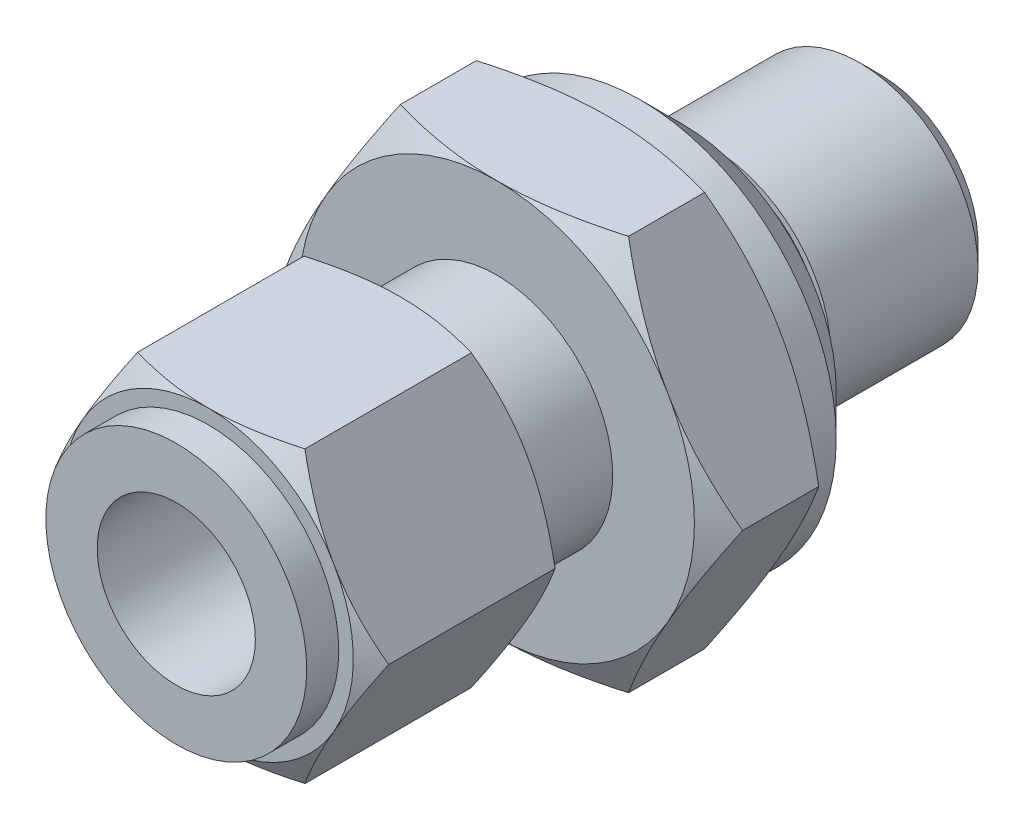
ISO-10303-21;
HEADER;
FILE_DESCRIPTION(('STEP AP214'),'2;1');
FILE_NAME('part.step','',(''),(''),'','','');
FILE_SCHEMA(('AUTOMOTIVE_DESIGN { 1 0 10303 214 1 1 1 1 }'));
ENDSEC;
DATA;
#1=APPLICATION_CONTEXT('core data for automotive mechanical design processes');
#2=APPLICATION_PROTOCOL_DEFINITION('international standard','automotive_design',2000,#1);
#3=PRODUCT_CONTEXT('',#1,'mechanical');
#4=PRODUCT('Part','Part','',(#3));
#5=PRODUCT_RELATED_PRODUCT_CATEGORY('part','',(#4));
#6=PRODUCT_DEFINITION_FORMATION('','',#4);
#7=PRODUCT_DEFINITION_CONTEXT('part definition',#1,'design');
#8=PRODUCT_DEFINITION('design','',#6,#7);
#9=PRODUCT_DEFINITION_SHAPE('','',#8);
#10=(LENGTH_UNIT() NAMED_UNIT(*) SI_UNIT(.MILLI.,.METRE.));
#11=(NAMED_UNIT(*) PLANE_ANGLE_UNIT() SI_UNIT($,.RADIAN.));
#12=(NAMED_UNIT(*) SI_UNIT($,.STERADIAN.) SOLID_ANGLE_UNIT());
#13=UNCERTAINTY_MEASURE_WITH_UNIT(LENGTH_MEASURE(1.E-05),#10,'distance_accuracy_value','');
#14=(GEOMETRIC_REPRESENTATION_CONTEXT(3) GLOBAL_UNCERTAINTY_ASSIGNED_CONTEXT((#13)) GLOBAL_UNIT_ASSIGNED_CONTEXT((#10,
#11,#12)) REPRESENTATION_CONTEXT('',''));
#15=CARTESIAN_POINT('',(0.,0.,0.));
#16=DIRECTION('',(0.,0.,1.));
#17=DIRECTION('',(1.,0.,0.));
#18=AXIS2_PLACEMENT_3D('',#15,#16,#17);
#19=CARTESIAN_POINT('',(0.,0.,-11.176));
#20=DIRECTION('',(0.,0.,-1.));
#21=DIRECTION('',(-1.,0.,0.));
#22=AXIS2_PLACEMENT_3D('',#19,#20,#21);
#23=PLANE('',#22);
#24=CARTESIAN_POINT('',(0.,0.,-11.176));
#25=DIRECTION('',(0.,0.,-1.));
#26=DIRECTION('',(-1.,0.,0.));
#27=AXIS2_PLACEMENT_3D('',#24,#25,#26);
#28=CIRCLE('',#27,9.27099999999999);
#29=CARTESIAN_POINT('',(-9.27099999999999,0.,-11.176));
#30=VERTEX_POINT('',#29);
#31=EDGE_CURVE('E450',#30,#30,#28,.T.);
#32=ORIENTED_EDGE('',*,*,#31,.T.);
#33=EDGE_LOOP('',(#32));
#34=FACE_BOUND('',#33,.T.);
#35=CARTESIAN_POINT('',(0.,0.,-11.176));
#36=DIRECTION('',(0.,0.,-1.));
#37=DIRECTION('',(-1.,0.,0.));
#38=AXIS2_PLACEMENT_3D('',#35,#36,#37);
#39=CIRCLE('',#38,6.7865625);
#40=CARTESIAN_POINT('',(-6.7865625,0.,-11.176));
#41=VERTEX_POINT('',#40);
#42=EDGE_CURVE('E390',#41,#41,#39,.T.);
#43=ORIENTED_EDGE('',*,*,#42,.F.);
#44=EDGE_LOOP('',(#43));
#45=FACE_BOUND('',#44,.T.);
#46=ADVANCED_FACE('F26',(#34,#45),#23,.T.);
#47=CARTESIAN_POINT('',(20.6222299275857,11.9062499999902,-6.70559999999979));
#48=DIRECTION('',(0.,0.,-1.));
#49=DIRECTION('',(-1.,0.,0.));
#50=AXIS2_PLACEMENT_3D('',#47,#48,#49);
#51=PLANE('',#50);
#52=CARTESIAN_POINT('',(0.,0.,-6.70559999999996));
#53=DIRECTION('',(0.,0.,-1.));
#54=DIRECTION('',(-1.,0.,0.));
#55=AXIS2_PLACEMENT_3D('',#52,#53,#54);
#56=CIRCLE('',#55,11.9062499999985);
#57=CARTESIAN_POINT('',(-1.48769885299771E-11,-11.9062500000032,-6.7056));
#58=VERTEX_POINT('',#57);
#59=CARTESIAN_POINT('',(-10.3111149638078,-5.9531249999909,-6.7056000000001));
#60=VERTEX_POINT('',#59);
#61=EDGE_CURVE('E229',#58,#60,#56,.T.);
#62=ORIENTED_EDGE('',*,*,#61,.T.);
#63=CARTESIAN_POINT('',(-10.3111149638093,5.953125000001,-6.70560000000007));
#64=VERTEX_POINT('',#63);
#65=EDGE_CURVE('E223',#60,#64,#56,.T.);
#66=ORIENTED_EDGE('',*,*,#65,.T.);
#67=CARTESIAN_POINT('',(9.43689570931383E-12,11.9062500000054,-6.70559999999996));
#68=VERTEX_POINT('',#67);
#69=EDGE_CURVE('E199',#64,#68,#56,.T.);
#70=ORIENTED_EDGE('',*,*,#69,.T.);
#71=CARTESIAN_POINT('',(10.3111149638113,5.95312499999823,-6.70559999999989));
#72=VERTEX_POINT('',#71);
#73=EDGE_CURVE('E188',#68,#72,#56,.T.);
#74=ORIENTED_EDGE('',*,*,#73,.T.);
#75=CARTESIAN_POINT('',(10.3111149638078,-5.95312499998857,-6.70559999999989));
#76=VERTEX_POINT('',#75);
#77=EDGE_CURVE('E200',#72,#76,#56,.T.);
#78=ORIENTED_EDGE('',*,*,#77,.T.);
#79=EDGE_CURVE('E231',#76,#58,#56,.T.);
#80=ORIENTED_EDGE('',*,*,#79,.T.);
#81=EDGE_LOOP('',(#62,#66,#70,#74,#78,#80));
#82=FACE_BOUND('',#81,.T.);
#83=CARTESIAN_POINT('',(0.,0.,-6.70559999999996));
#84=DIRECTION('',(0.,0.,-1.));
#85=DIRECTION('',(-1.,0.,0.));
#86=AXIS2_PLACEMENT_3D('',#83,#84,#85);
#87=CIRCLE('',#86,11.811);
#88=CARTESIAN_POINT('',(-11.811,0.,-6.70560000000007));
#89=VERTEX_POINT('',#88);
#90=EDGE_CURVE('E396',#89,#89,#87,.T.);
#91=ORIENTED_EDGE('',*,*,#90,.F.);
#92=EDGE_LOOP('',(#91));
#93=FACE_BOUND('',#92,.T.);
#94=ADVANCED_FACE('F221',(#82,#93),#51,.T.);
#95=CARTESIAN_POINT('',(0.,0.,17.3736));
#96=DIRECTION('',(0.,0.,1.));
#97=DIRECTION('',(1.,0.,0.));
#98=AXIS2_PLACEMENT_3D('',#95,#96,#97);
#99=CYLINDRICAL_SURFACE('',#98,7.858125);
#100=CARTESIAN_POINT('',(0.,0.,17.3736));
#101=DIRECTION('',(0.,0.,-1.));
#102=DIRECTION('',(-1.,0.,0.));
#103=AXIS2_PLACEMENT_3D('',#100,#101,#102);
#104=CIRCLE('',#103,7.858125);
#105=CARTESIAN_POINT('',(7.858125,0.,17.3735999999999));
#106=VERTEX_POINT('',#105);
#107=EDGE_CURVE('E441',#106,#106,#104,.F.);
#108=CARTESIAN_POINT('',(0.,0.,19.304));
#109=DIRECTION('',(0.,0.,1.));
#110=DIRECTION('',(1.,0.,0.));
#111=AXIS2_PLACEMENT_3D('',#108,#109,#110);
#112=CIRCLE('',#111,7.858125);
#113=CARTESIAN_POINT('',(7.85812500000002,0.,19.3039999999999));
#114=VERTEX_POINT('',#113);
#115=EDGE_CURVE('E447',#114,#114,#112,.T.);
#116=CARTESIAN_POINT('',(7.858125,0.,17.3735999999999));
#117=CARTESIAN_POINT('',(7.858125,0.,17.3937083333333));
#118=CARTESIAN_POINT('',(7.858125,0.,17.4138166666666));
#119=CARTESIAN_POINT('',(7.858125,0.,17.4540333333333));
#120=CARTESIAN_POINT('',(7.858125,0.,17.4741416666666));
#121=CARTESIAN_POINT('',(7.858125,0.,17.5143583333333));
#122=CARTESIAN_POINT('',(7.858125,0.,17.5344666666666));
#123=CARTESIAN_POINT('',(7.858125,0.,17.5746833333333));
#124=CARTESIAN_POINT('',(7.858125,0.,17.5947916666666));
#125=CARTESIAN_POINT('',(7.858125,0.,17.6350083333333));
#126=CARTESIAN_POINT('',(7.858125,0.,17.6551166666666));
#127=CARTESIAN_POINT('',(7.858125,0.,17.6953333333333));
#128=CARTESIAN_POINT('',(7.858125,0.,17.7154416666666));
#129=CARTESIAN_POINT('',(7.858125,0.,17.7556583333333));
#130=CARTESIAN_POINT('',(7.858125,0.,17.7757666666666));
#131=CARTESIAN_POINT('',(7.858125,0.,17.8159833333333));
#132=CARTESIAN_POINT('',(7.858125,0.,17.8360916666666));
#133=CARTESIAN_POINT('',(7.858125,0.,17.8763083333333));
#134=CARTESIAN_POINT('',(7.85812500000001,0.,17.8964166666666));
#135=CARTESIAN_POINT('',(7.85812500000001,0.,17.9366333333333));
#136=CARTESIAN_POINT('',(7.85812500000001,0.,17.9567416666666));
#137=CARTESIAN_POINT('',(7.85812500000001,0.,17.9969583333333));
#138=CARTESIAN_POINT('',(7.85812500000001,0.,18.0170666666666));
#139=CARTESIAN_POINT('',(7.85812500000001,0.,18.0572833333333));
#140=CARTESIAN_POINT('',(7.85812500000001,0.,18.0773916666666));
#141=CARTESIAN_POINT('',(7.85812500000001,0.,18.1176083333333));
#142=CARTESIAN_POINT('',(7.85812500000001,0.,18.1377166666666));
#143=CARTESIAN_POINT('',(7.85812500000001,0.,18.1779333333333));
#144=CARTESIAN_POINT('',(7.85812500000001,0.,18.1980416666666));
#145=CARTESIAN_POINT('',(7.85812500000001,0.,18.2382583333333));
#146=CARTESIAN_POINT('',(7.85812500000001,0.,18.2583666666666));
#147=CARTESIAN_POINT('',(7.85812500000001,0.,18.2985833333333));
#148=CARTESIAN_POINT('',(7.85812500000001,0.,18.3186916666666));
#149=CARTESIAN_POINT('',(7.85812500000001,0.,18.3589083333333));
#150=CARTESIAN_POINT('',(7.85812500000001,0.,18.3790166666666));
#151=CARTESIAN_POINT('',(7.85812500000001,0.,18.4192333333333));
#152=CARTESIAN_POINT('',(7.85812500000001,0.,18.4393416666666));
#153=CARTESIAN_POINT('',(7.85812500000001,0.,18.4795583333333));
#154=CARTESIAN_POINT('',(7.85812500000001,0.,18.4996666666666));
#155=CARTESIAN_POINT('',(7.85812500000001,0.,18.5398833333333));
#156=CARTESIAN_POINT('',(7.85812500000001,0.,18.5599916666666));
#157=CARTESIAN_POINT('',(7.85812500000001,0.,18.6002083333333));
#158=CARTESIAN_POINT('',(7.85812500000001,0.,18.6203166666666));
#159=CARTESIAN_POINT('',(7.85812500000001,0.,18.6605333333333));
#160=CARTESIAN_POINT('',(7.85812500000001,0.,18.6806416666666));
#161=CARTESIAN_POINT('',(7.85812500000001,0.,18.7208583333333));
#162=CARTESIAN_POINT('',(7.85812500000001,0.,18.7409666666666));
#163=CARTESIAN_POINT('',(7.85812500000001,0.,18.7811833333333));
#164=CARTESIAN_POINT('',(7.85812500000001,0.,18.8012916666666));
#165=CARTESIAN_POINT('',(7.85812500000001,0.,18.8415083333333));
#166=CARTESIAN_POINT('',(7.85812500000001,0.,18.8616166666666));
#167=CARTESIAN_POINT('',(7.85812500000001,0.,18.9018333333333));
#168=CARTESIAN_POINT('',(7.85812500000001,0.,18.9219416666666));
#169=CARTESIAN_POINT('',(7.85812500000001,0.,18.9621583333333));
#170=CARTESIAN_POINT('',(7.85812500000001,0.,18.9822666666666));
#171=CARTESIAN_POINT('',(7.85812500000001,0.,19.0224833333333));
#172=CARTESIAN_POINT('',(7.85812500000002,0.,19.0425916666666));
#173=CARTESIAN_POINT('',(7.85812500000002,0.,19.0828083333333));
#174=CARTESIAN_POINT('',(7.85812500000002,0.,19.1029166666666));
#175=CARTESIAN_POINT('',(7.85812500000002,0.,19.1431333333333));
#176=CARTESIAN_POINT('',(7.85812500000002,0.,19.1632416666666));
#177=CARTESIAN_POINT('',(7.85812500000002,0.,19.2034583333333));
#178=CARTESIAN_POINT('',(7.85812500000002,0.,19.2235666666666));
#179=CARTESIAN_POINT('',(7.85812500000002,0.,19.2637833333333));
#180=CARTESIAN_POINT('',(7.85812500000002,0.,19.2838916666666));
#181=CARTESIAN_POINT('',(7.85812500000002,0.,19.3039999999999));
#182=B_SPLINE_CURVE_WITH_KNOTS('',3,(#116,#117,#118,#119,#120,#121,#122,#123,#124,#125,#126,
#127,#128,#129,#130,#131,#132,#133,#134,#135,#136,#137,#138,#139,#140,#141,#142,#143,#144,#145,
#146,#147,#148,#149,#150,#151,#152,#153,#154,#155,#156,#157,#158,#159,#160,#161,#162,#163,#164,
#165,#166,#167,#168,#169,#170,#171,#172,#173,#174,#175,#176,#177,#178,#179,#180,#181),
.UNSPECIFIED.,.F.,.F.,(4,2,2,2,2,2,2,2,2,2,2,2,2,2,2,2,2,2,2,2,2,2,2,2,2,2,2,2,2,2,2,2,4),(0.,
0.0603250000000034,0.120650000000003,0.180975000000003,0.241300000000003,0.301625,
0.361950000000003,0.422275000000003,0.482600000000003,0.542925,0.60325,0.663575,
0.723900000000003,0.784225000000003,0.844550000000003,0.904875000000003,0.965200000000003,
1.025525,1.08585,1.146175,1.2065,1.266825,1.32715,1.387475,1.4478,1.508125,1.56845,1.628775,
1.6891,1.749425,1.80975,1.870075,1.9304),.UNSPECIFIED.);
#183=EDGE_CURVE('BSEAM28',#106,#114,#182,.T.);
#184=ORIENTED_EDGE('',*,*,#107,.T.);
#185=ORIENTED_EDGE('',*,*,#115,.F.);
#186=ORIENTED_EDGE('',*,*,#183,.T.);
#187=ORIENTED_EDGE('',*,*,#183,.F.);
#188=EDGE_LOOP('',(#184,#186,#185,#187));
#189=FACE_BOUND('',#188,.T.);
#190=ADVANCED_FACE('F28',(#189),#99,.T.);
#191=CARTESIAN_POINT('',(0.,0.,19.304));
#192=DIRECTION('',(0.,0.,1.));
#193=DIRECTION('',(1.,0.,0.));
#194=AXIS2_PLACEMENT_3D('',#191,#192,#193);
#195=PLANE('',#194);
#196=CARTESIAN_POINT('',(0.,0.,19.304));
#197=DIRECTION('',(0.,0.,1.));
#198=DIRECTION('',(1.,0.,0.));
#199=AXIS2_PLACEMENT_3D('',#196,#197,#198);
#200=CIRCLE('',#199,4.7625);
#201=CARTESIAN_POINT('',(4.76250000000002,0.,19.3039999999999));
#202=VERTEX_POINT('',#201);
#203=EDGE_CURVE('E444',#202,#202,#200,.T.);
#204=ORIENTED_EDGE('',*,*,#203,.F.);
#205=EDGE_LOOP('',(#204));
#206=FACE_BOUND('',#205,.T.);
#207=ORIENTED_EDGE('',*,*,#115,.T.);
#208=EDGE_LOOP('',(#207));
#209=FACE_BOUND('',#208,.T.);
#210=ADVANCED_FACE('F757',(#206,#209),#195,.T.);
#211=CARTESIAN_POINT('',(0.,0.,17.3736));
#212=DIRECTION('',(0.,0.,1.));
#213=DIRECTION('',(1.,0.,0.));
#214=AXIS2_PLACEMENT_3D('',#211,#212,#213);
#215=CYLINDRICAL_SURFACE('',#214,4.7625);
#216=CARTESIAN_POINT('',(0.,0.,5.79119999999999));
#217=DIRECTION('',(0.,0.,-1.));
#218=DIRECTION('',(-1.,0.,0.));
#219=AXIS2_PLACEMENT_3D('',#216,#217,#218);
#220=CIRCLE('',#219,4.7625);
#221=CARTESIAN_POINT('',(4.7624999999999,0.,5.79119999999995));
#222=VERTEX_POINT('',#221);
#223=EDGE_CURVE('E423',#222,#222,#220,.F.);
#224=CARTESIAN_POINT('',(4.76250000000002,0.,19.3039999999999));
#225=CARTESIAN_POINT('',(4.76250000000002,0.,19.1632416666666));
#226=CARTESIAN_POINT('',(4.76250000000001,0.,19.0224833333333));
#227=CARTESIAN_POINT('',(4.76250000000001,0.,18.7409666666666));
#228=CARTESIAN_POINT('',(4.76250000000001,0.,18.6002083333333));
#229=CARTESIAN_POINT('',(4.76250000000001,0.,18.3186916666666));
#230=CARTESIAN_POINT('',(4.76250000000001,0.,18.1779333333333));
#231=CARTESIAN_POINT('',(4.7625,0.,17.8964166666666));
#232=CARTESIAN_POINT('',(4.7625,0.,17.7556583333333));
#233=CARTESIAN_POINT('',(4.7625,0.,17.4741416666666));
#234=CARTESIAN_POINT('',(4.7625,0.,17.3333833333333));
#235=CARTESIAN_POINT('',(4.7625,0.,17.0518666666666));
#236=CARTESIAN_POINT('',(4.76249999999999,0.,16.9111083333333));
#237=CARTESIAN_POINT('',(4.76249999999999,0.,16.6295916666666));
#238=CARTESIAN_POINT('',(4.76249999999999,0.,16.4888333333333));
#239=CARTESIAN_POINT('',(4.76249999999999,0.,16.2073166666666));
#240=CARTESIAN_POINT('',(4.76249999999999,0.,16.0665583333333));
#241=CARTESIAN_POINT('',(4.76249999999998,0.,15.7850416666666));
#242=CARTESIAN_POINT('',(4.76249999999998,0.,15.6442833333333));
#243=CARTESIAN_POINT('',(4.76249999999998,0.,15.3627666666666));
#244=CARTESIAN_POINT('',(4.76249999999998,0.,15.2220083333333));
#245=CARTESIAN_POINT('',(4.76249999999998,0.,14.9404916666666));
#246=CARTESIAN_POINT('',(4.76249999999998,0.,14.7997333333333));
#247=CARTESIAN_POINT('',(4.76249999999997,0.,14.5182166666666));
#248=CARTESIAN_POINT('',(4.76249999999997,0.,14.3774583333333));
#249=CARTESIAN_POINT('',(4.76249999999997,0.,14.0959416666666));
#250=CARTESIAN_POINT('',(4.76249999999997,0.,13.9551833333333));
#251=CARTESIAN_POINT('',(4.76249999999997,0.,13.6736666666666));
#252=CARTESIAN_POINT('',(4.76249999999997,0.,13.5329083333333));
#253=CARTESIAN_POINT('',(4.76249999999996,0.,13.2513916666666));
#254=CARTESIAN_POINT('',(4.76249999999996,0.,13.1106333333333));
#255=CARTESIAN_POINT('',(4.76249999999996,0.,12.8291166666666));
#256=CARTESIAN_POINT('',(4.76249999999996,0.,12.6883583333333));
#257=CARTESIAN_POINT('',(4.76249999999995,0.,12.4068416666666));
#258=CARTESIAN_POINT('',(4.76249999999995,0.,12.2660833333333));
#259=CARTESIAN_POINT('',(4.76249999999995,0.,11.9845666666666));
#260=CARTESIAN_POINT('',(4.76249999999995,0.,11.8438083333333));
#261=CARTESIAN_POINT('',(4.76249999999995,0.,11.5622916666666));
#262=CARTESIAN_POINT('',(4.76249999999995,0.,11.4215333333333));
#263=CARTESIAN_POINT('',(4.76249999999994,0.,11.1400166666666));
#264=CARTESIAN_POINT('',(4.76249999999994,0.,10.9992583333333));
#265=CARTESIAN_POINT('',(4.76249999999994,0.,10.7177416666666));
#266=CARTESIAN_POINT('',(4.76249999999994,0.,10.5769833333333));
#267=CARTESIAN_POINT('',(4.76249999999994,0.,10.2954666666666));
#268=CARTESIAN_POINT('',(4.76249999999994,0.,10.1547083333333));
#269=CARTESIAN_POINT('',(4.76249999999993,0.,9.87319166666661));
#270=CARTESIAN_POINT('',(4.76249999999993,0.,9.73243333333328));
#271=CARTESIAN_POINT('',(4.76249999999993,0.,9.45091666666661));
#272=CARTESIAN_POINT('',(4.76249999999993,0.,9.31015833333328));
#273=CARTESIAN_POINT('',(4.76249999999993,0.,9.02864166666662));
#274=CARTESIAN_POINT('',(4.76249999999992,0.,8.88788333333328));
#275=CARTESIAN_POINT('',(4.76249999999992,0.,8.60636666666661));
#276=CARTESIAN_POINT('',(4.76249999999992,0.,8.46560833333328));
#277=CARTESIAN_POINT('',(4.76249999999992,0.,8.18409166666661));
#278=CARTESIAN_POINT('',(4.76249999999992,0.,8.04333333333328));
#279=CARTESIAN_POINT('',(4.76249999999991,0.,7.76181666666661));
#280=CARTESIAN_POINT('',(4.76249999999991,0.,7.62105833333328));
#281=CARTESIAN_POINT('',(4.76249999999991,0.,7.33954166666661));
#282=CARTESIAN_POINT('',(4.76249999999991,0.,7.19878333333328));
#283=CARTESIAN_POINT('',(4.76249999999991,0.,6.91726666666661));
#284=CARTESIAN_POINT('',(4.76249999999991,0.,6.77650833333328));
#285=CARTESIAN_POINT('',(4.7624999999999,0.,6.49499166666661));
#286=CARTESIAN_POINT('',(4.7624999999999,0.,6.35423333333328));
#287=CARTESIAN_POINT('',(4.7624999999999,0.,6.07271666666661));
#288=CARTESIAN_POINT('',(4.7624999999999,0.,5.93195833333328));
#289=CARTESIAN_POINT('',(4.7624999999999,0.,5.79119999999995));
#290=B_SPLINE_CURVE_WITH_KNOTS('',3,(#224,#225,#226,#227,#228,#229,#230,#231,#232,#233,#234,
#235,#236,#237,#238,#239,#240,#241,#242,#243,#244,#245,#246,#247,#248,#249,#250,#251,#252,#253,
#254,#255,#256,#257,#258,#259,#260,#261,#262,#263,#264,#265,#266,#267,#268,#269,#270,#271,#272,
#273,#274,#275,#276,#277,#278,#279,#280,#281,#282,#283,#284,#285,#286,#287,#288,#289),
.UNSPECIFIED.,.F.,.F.,(4,2,2,2,2,2,2,2,2,2,2,2,2,2,2,2,2,2,2,2,2,2,2,2,2,2,2,2,2,2,2,2,4),(0.,
0.422275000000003,0.844550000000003,1.266825,1.6891,2.111375,2.53365,2.955925,3.3782,3.800475,
4.22275,4.645025,5.0673,5.489575,5.91185,6.334125,6.7564,7.178675,7.60095,8.023225,8.4455,
8.86777500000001,9.29005,9.712325,10.1346,10.556875,10.97915,11.401425,11.8237,12.245975,
12.66825,13.090525,13.5128),.UNSPECIFIED.);
#291=EDGE_CURVE('BSEAM623',#202,#222,#290,.T.);
#292=ORIENTED_EDGE('',*,*,#203,.T.);
#293=ORIENTED_EDGE('',*,*,#223,.F.);
#294=ORIENTED_EDGE('',*,*,#291,.T.);
#295=ORIENTED_EDGE('',*,*,#291,.F.);
#296=EDGE_LOOP('',(#292,#294,#293,#295));
#297=FACE_BOUND('',#296,.T.);
#298=ADVANCED_FACE('F623',(#297),#215,.F.);
#299=CARTESIAN_POINT('',(5.04098953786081,-8.73125000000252,17.3736));
#300=DIRECTION('',(0.,0.,-1.));
#301=DIRECTION('',(-1.,0.,0.));
#302=AXIS2_PLACEMENT_3D('',#299,#300,#301);
#303=PLANE('',#302);
#304=ORIENTED_EDGE('',*,*,#107,.F.);
#305=EDGE_LOOP('',(#304));
#306=FACE_BOUND('',#305,.T.);
#307=CARTESIAN_POINT('',(0.,0.,17.3736));
#308=DIRECTION('',(0.,0.,-1.));
#309=DIRECTION('',(-1.,0.,0.));
#310=AXIS2_PLACEMENT_3D('',#307,#308,#309);
#311=CIRCLE('',#310,8.73124999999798);
#312=CARTESIAN_POINT('',(-7.56148430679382,-4.36562499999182,17.3735999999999));
#313=VERTEX_POINT('',#312);
#314=CARTESIAN_POINT('',(-7.56148430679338,4.36562500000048,17.3736));
#315=VERTEX_POINT('',#314);
#316=EDGE_CURVE('E233',#313,#315,#311,.T.);
#317=ORIENTED_EDGE('',*,*,#316,.F.);
#318=CARTESIAN_POINT('',(-1.80966353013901E-11,-8.7312499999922,17.3736));
#319=VERTEX_POINT('',#318);
#320=EDGE_CURVE('E240',#319,#313,#311,.T.);
#321=ORIENTED_EDGE('',*,*,#320,.F.);
#322=CARTESIAN_POINT('',(7.56148430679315,-4.36562500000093,17.3736000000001));
#323=VERTEX_POINT('',#322);
#324=EDGE_CURVE('E246',#323,#319,#311,.T.);
#325=ORIENTED_EDGE('',*,*,#324,.F.);
#326=CARTESIAN_POINT('',(7.56148430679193,4.36562500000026,17.3736000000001));
#327=VERTEX_POINT('',#326);
#328=EDGE_CURVE('E238',#327,#323,#311,.T.);
#329=ORIENTED_EDGE('',*,*,#328,.F.);
#330=CARTESIAN_POINT('',(9.54791801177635E-12,8.73125000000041,17.3736));
#331=VERTEX_POINT('',#330);
#332=EDGE_CURVE('E232',#331,#327,#311,.T.);
#333=ORIENTED_EDGE('',*,*,#332,.F.);
#334=EDGE_CURVE('E230',#315,#331,#311,.T.);
#335=ORIENTED_EDGE('',*,*,#334,.F.);
#336=EDGE_LOOP('',(#317,#321,#325,#329,#333,#335));
#337=FACE_BOUND('',#336,.T.);
#338=ADVANCED_FACE('F620',(#306,#337),#303,.F.);
#339=CARTESIAN_POINT('',(0.,0.,5.79119999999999));
#340=DIRECTION('',(0.,0.,-1.));
#341=DIRECTION('',(-1.,0.,0.));
#342=AXIS2_PLACEMENT_3D('',#339,#340,#341);
#343=PLANE('',#342);
#344=CARTESIAN_POINT('',(0.,0.,5.79119999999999));
#345=DIRECTION('',(0.,0.,-1.));
#346=DIRECTION('',(-1.,0.,0.));
#347=AXIS2_PLACEMENT_3D('',#344,#345,#346);
#348=CIRCLE('',#347,3.556);
#349=CARTESIAN_POINT('',(-3.556,0.,5.79119999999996));
#350=VERTEX_POINT('',#349);
#351=EDGE_CURVE('E414',#350,#350,#348,.T.);
#352=ORIENTED_EDGE('',*,*,#351,.T.);
#353=EDGE_LOOP('',(#352));
#354=FACE_BOUND('',#353,.T.);
#355=ORIENTED_EDGE('',*,*,#223,.T.);
#356=EDGE_LOOP('',(#355));
#357=FACE_BOUND('',#356,.T.);
#358=ADVANCED_FACE('F622',(#354,#357),#343,.F.);
#359=CARTESIAN_POINT('',(0.,0.,0.));
#360=DIRECTION('',(0.,0.,1.));
#361=DIRECTION('',(1.,0.,0.));
#362=AXIS2_PLACEMENT_3D('',#359,#360,#361);
#363=CYLINDRICAL_SURFACE('',#362,3.556);
#364=ORIENTED_EDGE('',*,*,#351,.F.);
#365=EDGE_LOOP('',(#364));
#366=FACE_BOUND('',#365,.T.);
#367=CARTESIAN_POINT('',(0.,0.,-23.114));
#368=DIRECTION('',(0.,0.,-1.));
#369=DIRECTION('',(-1.,0.,0.));
#370=AXIS2_PLACEMENT_3D('',#367,#368,#369);
#371=CIRCLE('',#370,3.556);
#372=CARTESIAN_POINT('',(-3.556,0.,-23.114));
#373=VERTEX_POINT('',#372);
#374=EDGE_CURVE('E384',#373,#373,#371,.T.);
#375=ORIENTED_EDGE('',*,*,#374,.T.);
#376=EDGE_LOOP('',(#375));
#377=FACE_BOUND('',#376,.T.);
#378=ADVANCED_FACE('F597',(#366,#377),#363,.F.);
#379=CARTESIAN_POINT('',(0.,0.,-11.176));
#380=DIRECTION('',(0.,0.,1.));
#381=DIRECTION('',(1.,0.,0.));
#382=AXIS2_PLACEMENT_3D('',#379,#380,#381);
#383=CYLINDRICAL_SURFACE('',#382,11.811);
#384=CARTESIAN_POINT('',(0.,0.,-8.63599999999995));
#385=DIRECTION('',(0.,0.,-1.));
#386=DIRECTION('',(-1.,0.,0.));
#387=AXIS2_PLACEMENT_3D('',#384,#385,#386);
#388=CIRCLE('',#387,11.811);
#389=CARTESIAN_POINT('',(-11.811,0.,-8.63600000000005));
#390=VERTEX_POINT('',#389);
#391=EDGE_CURVE('E453',#390,#390,#388,.F.);
#392=ORIENTED_EDGE('',*,*,#391,.T.);
#393=EDGE_LOOP('',(#392));
#394=FACE_BOUND('',#393,.T.);
#395=ORIENTED_EDGE('',*,*,#90,.T.);
#396=EDGE_LOOP('',(#395));
#397=FACE_BOUND('',#396,.T.);
#398=ADVANCED_FACE('F594',(#394,#397),#383,.T.);
#399=CARTESIAN_POINT('',(0.,0.,-12.9667));
#400=DIRECTION('',(0.,0.,1.));
#401=DIRECTION('',(1.,0.,0.));
#402=AXIS2_PLACEMENT_3D('',#399,#400,#401);
#403=CYLINDRICAL_SURFACE('',#402,6.7865625);
#404=CARTESIAN_POINT('',(0.,0.,-12.9667));
#405=DIRECTION('',(0.,0.,-1.));
#406=DIRECTION('',(-1.,0.,0.));
#407=AXIS2_PLACEMENT_3D('',#404,#405,#406);
#408=CIRCLE('',#407,6.7865625);
#409=CARTESIAN_POINT('',(-6.7865625,0.,-12.9667000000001));
#410=VERTEX_POINT('',#409);
#411=EDGE_CURVE('E393',#410,#410,#408,.T.);
#412=ORIENTED_EDGE('',*,*,#411,.F.);
#413=EDGE_LOOP('',(#412));
#414=FACE_BOUND('',#413,.T.);
#415=ORIENTED_EDGE('',*,*,#42,.T.);
#416=EDGE_LOOP('',(#415));
#417=FACE_BOUND('',#416,.T.);
#418=ADVANCED_FACE('F592',(#414,#417),#403,.T.);
#419=CARTESIAN_POINT('',(0.,0.,-12.9667));
#420=DIRECTION('',(0.,0.,-1.));
#421=DIRECTION('',(-1.,0.,0.));
#422=AXIS2_PLACEMENT_3D('',#419,#420,#421);
#423=PLANE('',#422);
#424=CARTESIAN_POINT('',(0.,0.,-12.9667));
#425=DIRECTION('',(0.,0.,-1.));
#426=DIRECTION('',(-1.,0.,0.));
#427=AXIS2_PLACEMENT_3D('',#424,#425,#426);
#428=CIRCLE('',#427,7.14375);
#429=CARTESIAN_POINT('',(-7.14375,0.,-12.9667000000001));
#430=VERTEX_POINT('',#429);
#431=EDGE_CURVE('E387',#430,#430,#428,.T.);
#432=ORIENTED_EDGE('',*,*,#431,.F.);
#433=EDGE_LOOP('',(#432));
#434=FACE_BOUND('',#433,.T.);
#435=ORIENTED_EDGE('',*,*,#411,.T.);
#436=EDGE_LOOP('',(#435));
#437=FACE_BOUND('',#436,.T.);
#438=ADVANCED_FACE('F639',(#434,#437),#423,.F.);
#439=CARTESIAN_POINT('',(0.,0.,-23.114));
#440=DIRECTION('',(0.,0.,-1.));
#441=DIRECTION('',(-1.,0.,0.));
#442=AXIS2_PLACEMENT_3D('',#439,#440,#441);
#443=PLANE('',#442);
#444=CARTESIAN_POINT('',(0.,0.,-23.114));
#445=DIRECTION('',(0.,0.,-1.));
#446=DIRECTION('',(-1.,0.,0.));
#447=AXIS2_PLACEMENT_3D('',#444,#445,#446);
#448=CIRCLE('',#447,5.87375);
#449=CARTESIAN_POINT('',(-5.87375,0.,-23.114));
#450=VERTEX_POINT('',#449);
#451=EDGE_CURVE('E34',#450,#450,#448,.T.);
#452=ORIENTED_EDGE('',*,*,#451,.T.);
#453=EDGE_LOOP('',(#452));
#454=FACE_BOUND('',#453,.T.);
#455=ORIENTED_EDGE('',*,*,#374,.F.);
#456=EDGE_LOOP('',(#455));
#457=FACE_BOUND('',#456,.T.);
#458=ADVANCED_FACE('F636',(#454,#457),#443,.T.);
#459=CARTESIAN_POINT('',(0.,0.,-23.114));
#460=DIRECTION('',(0.,0.,1.));
#461=DIRECTION('',(1.,0.,0.));
#462=AXIS2_PLACEMENT_3D('',#459,#460,#461);
#463=CYLINDRICAL_SURFACE('',#462,7.14375);
#464=CARTESIAN_POINT('',(0.,0.,-21.844));
#465=DIRECTION('',(0.,0.,-1.));
#466=DIRECTION('',(-1.,0.,0.));
#467=AXIS2_PLACEMENT_3D('',#464,#465,#466);
#468=CIRCLE('',#467,7.14375);
#469=CARTESIAN_POINT('',(-7.14375,0.,-21.8440000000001));
#470=VERTEX_POINT('',#469);
#471=EDGE_CURVE('E11',#470,#470,#468,.F.);
#472=ORIENTED_EDGE('',*,*,#471,.T.);
#473=EDGE_LOOP('',(#472));
#474=FACE_BOUND('',#473,.T.);
#475=ORIENTED_EDGE('',*,*,#431,.T.);
#476=EDGE_LOOP('',(#475));
#477=FACE_BOUND('',#476,.T.);
#478=ADVANCED_FACE('F638',(#474,#477),#463,.T.);
#479=CARTESIAN_POINT('',(0.,0.,-11.176));
#480=DIRECTION('',(0.,0.,1.));
#481=DIRECTION('',(1.,0.,0.));
#482=AXIS2_PLACEMENT_3D('',#479,#480,#481);
#483=CONICAL_SURFACE('',#482,9.27099999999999,0.785398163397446);
#484=ORIENTED_EDGE('',*,*,#391,.F.);
#485=EDGE_LOOP('',(#484));
#486=FACE_BOUND('',#485,.T.);
#487=ORIENTED_EDGE('',*,*,#31,.F.);
#488=EDGE_LOOP('',(#487));
#489=FACE_BOUND('',#488,.T.);
#490=ADVANCED_FACE('F646',(#486,#489),#483,.T.);
#491=CARTESIAN_POINT('',(0.,0.,-5.64217664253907));
#492=DIRECTION('',(0.,0.,1.));
#493=DIRECTION('',(1.,0.,0.));
#494=AXIS2_PLACEMENT_3D('',#491,#492,#493);
#495=CONICAL_SURFACE('',#494,13.7481532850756,1.04719755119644);
#496=CARTESIAN_POINT('',(-6.8739611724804,11.9064500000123,-5.64210997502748));
#497=CARTESIAN_POINT('',(-7.02506816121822,11.6447250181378,-5.72933697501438));
#498=CARTESIAN_POINT('',(-7.17673855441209,11.3820241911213,-5.8126049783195));
#499=CARTESIAN_POINT('',(-7.48129562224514,10.8545158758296,-5.97012449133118));
#500=CARTESIAN_POINT('',(-7.634182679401,10.5897077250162,-6.04437303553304));
#501=CARTESIAN_POINT('',(-8.0953073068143,9.79101644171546,-6.2521525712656));
#502=CARTESIAN_POINT('',(-8.40536522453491,9.25398037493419,-6.37033634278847));
#503=CARTESIAN_POINT('',(-8.86935268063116,8.45033052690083,-6.50891740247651));
#504=CARTESIAN_POINT('',(-9.02189605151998,8.18611765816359,-6.54839385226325));
#505=CARTESIAN_POINT('',(-9.32768907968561,7.6564685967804,-6.61459307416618));
#506=CARTESIAN_POINT('',(-9.48093875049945,7.39103238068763,-6.6413156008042));
#507=CARTESIAN_POINT('',(-9.78769358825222,6.85971741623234,-6.68132249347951));
#508=CARTESIAN_POINT('',(-9.9411982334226,6.59383957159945,-6.69462282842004));
#509=CARTESIAN_POINT('',(-10.2483497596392,6.06183752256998,-6.70750192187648));
#510=CARTESIAN_POINT('',(-10.4019966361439,5.79571332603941,-6.70708110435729));
#511=CARTESIAN_POINT('',(-10.6892397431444,5.29819367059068,-6.69347549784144));
#512=CARTESIAN_POINT('',(-10.8228564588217,5.06676273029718,-6.68195029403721));
#513=CARTESIAN_POINT('',(-11.0897825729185,4.60443313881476,-6.64873977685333));
#514=CARTESIAN_POINT('',(-11.2230919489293,4.37353452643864,-6.62705374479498));
#515=CARTESIAN_POINT('',(-11.4893309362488,3.91239507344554,-6.57389964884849));
#516=CARTESIAN_POINT('',(-11.622260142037,3.68215493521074,-6.54242350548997));
#517=CARTESIAN_POINT('',(-11.8874953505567,3.22275407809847,-6.47024145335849));
#518=CARTESIAN_POINT('',(-12.019801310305,2.99359343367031,-6.42953491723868));
#519=CARTESIAN_POINT('',(-12.4214234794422,2.29796343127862,-6.2925406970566));
#520=CARTESIAN_POINT('',(-12.6895766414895,1.83350853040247,-6.18259312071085));
#521=CARTESIAN_POINT('',(-13.2218844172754,0.911524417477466,-5.93305692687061));
#522=CARTESIAN_POINT('',(-13.4860458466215,0.453983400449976,-5.79352691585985));
#523=CARTESIAN_POINT('',(-13.7482687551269,-0.000199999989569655,-5.6421099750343));
#524=B_SPLINE_CURVE_WITH_KNOTS('',3,(#496,#497,#498,#499,#500,#501,#502,#503,#504,#505,#506,
#507,#508,#509,#510,#511,#512,#513,#514,#515,#516,#517,#518,#519,#520,#521,#522,#523),
.UNSPECIFIED.,.F.,.F.,(4,2,2,2,2,2,2,2,2,2,2,2,2,4),(0.,0.943575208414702,1.88745981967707,
3.77924706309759,4.70192280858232,5.62461631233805,6.54621075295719,7.46777671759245,
8.27002897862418,9.07233799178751,9.8753108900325,10.6783383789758,12.3197076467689,
13.9578550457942),.UNSPECIFIED.);
#525=CARTESIAN_POINT('',(-13.748153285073,1.04360964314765E-11,-5.64217664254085));
#526=VERTEX_POINT('',#525);
#527=EDGE_CURVE('E455',#64,#526,#524,.T.);
#528=ORIENTED_EDGE('',*,*,#527,.F.);
#529=ORIENTED_EDGE('',*,*,#65,.F.);
#530=CARTESIAN_POINT('',(-13.7482687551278,0.000200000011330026,-5.6421099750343));
#531=CARTESIAN_POINT('',(-13.5971617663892,-0.261524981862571,-5.72933697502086));
#532=CARTESIAN_POINT('',(-13.4454913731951,-0.524225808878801,-5.81260497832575));
#533=CARTESIAN_POINT('',(-13.1409343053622,-1.05173412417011,-5.97012449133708));
#534=CARTESIAN_POINT('',(-12.9880472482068,-1.31654227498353,-6.04437303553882));
#535=CARTESIAN_POINT('',(-12.5269226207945,-2.11523355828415,-6.25215257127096));
#536=CARTESIAN_POINT('',(-12.2168647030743,-2.65226962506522,-6.37033634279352));
#537=CARTESIAN_POINT('',(-11.7528772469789,-3.45591947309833,-6.50891740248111));
#538=CARTESIAN_POINT('',(-11.6003338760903,-3.7201323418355,-6.54839385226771));
#539=CARTESIAN_POINT('',(-11.2945408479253,-4.24978140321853,-6.61459307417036));
#540=CARTESIAN_POINT('',(-11.1412911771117,-4.51521761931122,-6.64131560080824));
#541=CARTESIAN_POINT('',(-10.8345363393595,-5.04653258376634,-6.6813224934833));
#542=CARTESIAN_POINT('',(-10.6810316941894,-5.31241042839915,-6.69462282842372));
#543=CARTESIAN_POINT('',(-10.3738801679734,-5.84441247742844,-6.70750192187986));
#544=CARTESIAN_POINT('',(-10.2202332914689,-6.11053667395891,-6.70708110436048));
#545=CARTESIAN_POINT('',(-9.9329901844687,-6.60805632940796,-6.69347549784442));
#546=CARTESIAN_POINT('',(-9.79937346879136,-6.83948726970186,-6.68195029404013));
#547=CARTESIAN_POINT('',(-9.53244735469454,-7.30181686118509,-6.64873977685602));
#548=CARTESIAN_POINT('',(-9.39913797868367,-7.53271547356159,-6.62705374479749));
#549=CARTESIAN_POINT('',(-9.1328989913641,-7.99385492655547,-6.57389964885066));
#550=CARTESIAN_POINT('',(-8.99996978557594,-8.22409506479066,-6.54242350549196));
#551=CARTESIAN_POINT('',(-8.73473457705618,-8.68349592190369,-6.4702414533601));
#552=CARTESIAN_POINT('',(-8.60242861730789,-8.91265656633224,-6.42953491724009));
#553=CARTESIAN_POINT('',(-8.20080644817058,-9.60828656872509,-6.29254069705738));
#554=CARTESIAN_POINT('',(-7.93265328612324,-10.072741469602,-6.18259312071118));
#555=CARTESIAN_POINT('',(-7.40034551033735,-10.9947255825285,-5.93305692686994));
#556=CARTESIAN_POINT('',(-7.1361840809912,-11.4522665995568,-5.79352691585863));
#557=CARTESIAN_POINT('',(-6.87396117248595,-11.9064499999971,-5.64210997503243));
#558=B_SPLINE_CURVE_WITH_KNOTS('',3,(#530,#531,#532,#533,#534,#535,#536,#537,#538,#539,#540,
#541,#542,#543,#544,#545,#546,#547,#548,#549,#550,#551,#552,#553,#554,#555,#556,#557),
.UNSPECIFIED.,.F.,.F.,(4,2,2,2,2,2,2,2,2,2,2,2,2,4),(0.,0.943575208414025,1.88745981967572,
3.77924706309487,4.70192280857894,5.62461631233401,6.54621075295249,7.46777671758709,
8.27002897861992,9.07233799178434,9.87531089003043,10.6783383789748,12.3197076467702,
13.9578550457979),.UNSPECIFIED.);
#559=EDGE_CURVE('E212',#526,#60,#558,.T.);
#560=ORIENTED_EDGE('',*,*,#559,.F.);
#561=EDGE_LOOP('',(#528,#529,#560));
#562=FACE_BOUND('',#561,.T.);
#563=ADVANCED_FACE('F470',(#562),#495,.T.);
#564=ORIENTED_EDGE('',*,*,#69,.F.);
#565=CARTESIAN_POINT('',(-6.8740766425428,11.9062499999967,-5.64217664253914));
#566=VERTEX_POINT('',#565);
#567=EDGE_CURVE('E208',#566,#64,#524,.T.);
#568=ORIENTED_EDGE('',*,*,#567,.F.);
#569=CARTESIAN_POINT('',(-18.2310642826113,11.9062500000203,-1.00814141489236));
#570=CARTESIAN_POINT('',(-17.9696981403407,11.9062500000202,-1.13448193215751));
#571=CARTESIAN_POINT('',(-17.7080160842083,11.90625000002,-1.26016858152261));
#572=CARTESIAN_POINT('',(-17.1839534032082,11.9062500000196,-1.51008405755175));
#573=CARTESIAN_POINT('',(-16.9215727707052,11.9062500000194,-1.63431286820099));
#574=CARTESIAN_POINT('',(-16.1332060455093,11.9062500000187,-2.00462341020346));
#575=CARTESIAN_POINT('',(-15.6060800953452,11.9062500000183,-2.24828805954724));
#576=CARTESIAN_POINT('',(-14.5451691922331,11.9062500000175,-2.72899299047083));
#577=CARTESIAN_POINT('',(-14.0113633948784,11.9062500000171,-2.96598738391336));
#578=CARTESIAN_POINT('',(-12.9393649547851,11.9062500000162,-3.42980073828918));
#579=CARTESIAN_POINT('',(-12.4011725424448,11.9062500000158,-3.65662022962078));
#580=CARTESIAN_POINT('',(-11.3128639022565,11.9062500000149,-4.10006436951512));
#581=CARTESIAN_POINT('',(-10.7626824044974,11.9062500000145,-4.31652967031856));
#582=CARTESIAN_POINT('',(-9.65582612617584,11.9062500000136,-4.73250752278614));
#583=CARTESIAN_POINT('',(-9.09915063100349,11.9062500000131,-4.93201818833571));
#584=CARTESIAN_POINT('',(-7.97958241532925,11.9062500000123,-5.30872327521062));
#585=CARTESIAN_POINT('',(-7.41670579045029,11.906250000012,-5.48596514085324));
#586=CARTESIAN_POINT('',(-6.28289628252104,11.9062500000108,-5.81238509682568));
#587=CARTESIAN_POINT('',(-5.71196600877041,11.90625000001,-5.96157206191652));
#588=CARTESIAN_POINT('',(-4.84942178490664,11.9062500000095,-6.15885006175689));
#589=CARTESIAN_POINT('',(-4.56082103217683,11.9062500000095,-6.22020241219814));
#590=CARTESIAN_POINT('',(-3.98169852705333,11.9062500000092,-6.33310421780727));
#591=CARTESIAN_POINT('',(-3.69117681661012,11.9062500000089,-6.38465388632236));
#592=CARTESIAN_POINT('',(-3.10840167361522,11.9062500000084,-6.47703730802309));
#593=CARTESIAN_POINT('',(-2.81614810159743,11.9062500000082,-6.51787018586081));
#594=CARTESIAN_POINT('',(-2.23026203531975,11.9062500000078,-6.58799703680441));
#595=CARTESIAN_POINT('',(-1.93662959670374,11.9062500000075,-6.6172914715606));
#596=CARTESIAN_POINT('',(-1.35026037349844,11.9062500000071,-6.66355566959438));
#597=CARTESIAN_POINT('',(-1.05752969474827,11.9062500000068,-6.68060231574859));
#598=CARTESIAN_POINT('',(-0.471609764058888,11.9062500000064,-6.70228040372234));
#599=CARTESIAN_POINT('',(-0.178420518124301,11.9062500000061,-6.70691200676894));
#600=CARTESIAN_POINT('',(0.407807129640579,11.9062500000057,-6.70365012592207));
#601=CARTESIAN_POINT('',(0.700845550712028,11.9062500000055,-6.6957601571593));
#602=CARTESIAN_POINT('',(1.28633438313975,11.9062500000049,-6.66765120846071));
#603=CARTESIAN_POINT('',(1.5787847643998,11.9062500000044,-6.64743161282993));
#604=CARTESIAN_POINT('',(2.28759447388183,11.9062500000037,-6.58390543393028));
#605=CARTESIAN_POINT('',(2.70340921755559,11.9062500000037,-6.5344212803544));
#606=CARTESIAN_POINT('',(3.5318523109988,11.9062500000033,-6.41327431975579));
#607=CARTESIAN_POINT('',(3.94447975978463,11.9062500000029,-6.3416054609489));
#608=CARTESIAN_POINT('',(4.76620792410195,11.9062500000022,-6.17863086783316));
#609=CARTESIAN_POINT('',(5.17530492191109,11.9062500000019,-6.08730656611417));
#610=CARTESIAN_POINT('',(5.98928984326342,11.9062500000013,-5.88780782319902));
#611=CARTESIAN_POINT('',(6.39417815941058,11.9062500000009,-5.77963496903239));
#612=CARTESIAN_POINT('',(7.20971827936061,11.9062500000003,-5.5461981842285));
#613=CARTESIAN_POINT('',(7.6202680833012,11.90625,-5.42058030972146));
#614=CARTESIAN_POINT('',(8.43702737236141,11.9062499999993,-5.15693659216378));
#615=CARTESIAN_POINT('',(8.84323963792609,11.906249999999,-5.01891930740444));
#616=CARTESIAN_POINT('',(9.6496976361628,11.9062499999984,-4.73331012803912));
#617=CARTESIAN_POINT('',(10.0499640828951,11.906249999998,-4.58577649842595));
#618=CARTESIAN_POINT('',(10.6479905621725,11.9062499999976,-4.35803415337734));
#619=CARTESIAN_POINT('',(10.8469797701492,11.9062499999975,-4.28102911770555));
#620=CARTESIAN_POINT('',(11.2441841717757,11.9062499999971,-4.12506062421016));
#621=CARTESIAN_POINT('',(11.4423993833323,11.9062499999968,-4.04609721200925));
#622=CARTESIAN_POINT('',(11.6402554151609,11.9062499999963,-3.96624272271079));
#623=B_SPLINE_CURVE_WITH_KNOTS('',3,(#569,#570,#571,#572,#573,#574,#575,#576,#577,#578,#579,
#580,#581,#582,#583,#584,#585,#586,#587,#588,#589,#590,#591,#592,#593,#594,#595,#596,#597,#598,
#599,#600,#601,#602,#603,#604,#605,#606,#607,#608,#609,#610,#611,#612,#613,#614,#615,#616,#617,
#618,#619,#620,#621,#622),.UNSPECIFIED.,.F.,.F.,(4,2,2,2,2,2,2,2,2,2,2,2,2,2,2,2,2,2,2,2,2,2,2,
2,2,2,4),(0.,0.87089880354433,1.74180716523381,3.48390715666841,5.23597648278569,
6.98795437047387,8.76144110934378,10.5351248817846,12.304963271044,14.0742408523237,
14.959251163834,15.8442422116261,16.7293055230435,17.6143334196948,18.4937560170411,
19.3731671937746,20.2523315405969,21.1315397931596,22.3870866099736,23.6429762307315,
24.9000574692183,26.1570203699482,27.4447941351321,28.7316857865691,30.0113339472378,
30.6514336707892,31.2915184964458),.UNSPECIFIED.);
#624=EDGE_CURVE('E205',#68,#566,#623,.F.);
#625=ORIENTED_EDGE('',*,*,#624,.F.);
#626=EDGE_LOOP('',(#564,#568,#625));
#627=FACE_BOUND('',#626,.T.);
#628=ADVANCED_FACE('F206',(#627),#495,.T.);
#629=CARTESIAN_POINT('',(-6.87407664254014,-11.9062499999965,-5.64217664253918));
#630=VERTEX_POINT('',#629);
#631=EDGE_CURVE('E219',#60,#630,#558,.T.);
#632=ORIENTED_EDGE('',*,*,#631,.F.);
#633=ORIENTED_EDGE('',*,*,#61,.F.);
#634=CARTESIAN_POINT('',(-18.231064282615,-11.9062499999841,-1.00814141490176));
#635=CARTESIAN_POINT('',(-17.9696981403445,-11.9062499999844,-1.13448193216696));
#636=CARTESIAN_POINT('',(-17.7080160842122,-11.9062499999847,-1.26016858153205));
#637=CARTESIAN_POINT('',(-17.1839534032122,-11.9062499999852,-1.51008405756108));
#638=CARTESIAN_POINT('',(-16.9215727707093,-11.9062499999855,-1.63431286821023));
#639=CARTESIAN_POINT('',(-16.1332060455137,-11.9062499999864,-2.00462341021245));
#640=CARTESIAN_POINT('',(-15.6060800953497,-11.906249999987,-2.24828805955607));
#641=CARTESIAN_POINT('',(-14.545169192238,-11.9062499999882,-2.72899299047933));
#642=CARTESIAN_POINT('',(-14.0113633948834,-11.9062499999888,-2.96598738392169));
#643=CARTESIAN_POINT('',(-12.9393649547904,-11.90624999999,-3.42980073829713));
#644=CARTESIAN_POINT('',(-12.4011725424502,-11.9062499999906,-3.65662022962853));
#645=CARTESIAN_POINT('',(-11.3128639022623,-11.9062499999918,-4.10006436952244));
#646=CARTESIAN_POINT('',(-10.7626824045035,-11.9062499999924,-4.31652967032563));
#647=CARTESIAN_POINT('',(-9.65582612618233,-11.9062499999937,-4.73250752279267));
#648=CARTESIAN_POINT('',(-9.0991506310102,-11.9062499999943,-4.93201818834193));
#649=CARTESIAN_POINT('',(-7.97958241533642,-11.9062499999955,-5.30872327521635));
#650=CARTESIAN_POINT('',(-7.4167057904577,-11.9062499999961,-5.48596514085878));
#651=CARTESIAN_POINT('',(-6.28289628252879,-11.9062499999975,-5.81238509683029));
#652=CARTESIAN_POINT('',(-5.71196600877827,-11.9062499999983,-5.96157206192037));
#653=CARTESIAN_POINT('',(-4.84942178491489,-11.9062499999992,-6.15885006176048));
#654=CARTESIAN_POINT('',(-4.56082103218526,-11.9062499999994,-6.22020241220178));
#655=CARTESIAN_POINT('',(-3.98169852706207,-11.90625,-6.3331042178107));
#656=CARTESIAN_POINT('',(-3.69117681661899,-11.9062500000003,-6.38465388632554));
#657=CARTESIAN_POINT('',(-3.10840167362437,-11.906250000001,-6.47703730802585));
#658=CARTESIAN_POINT('',(-2.81614810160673,-11.9062500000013,-6.51787018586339));
#659=CARTESIAN_POINT('',(-2.23026203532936,-11.906250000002,-6.58799703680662));
#660=CARTESIAN_POINT('',(-1.93662959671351,-11.9062500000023,-6.61729147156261));
#661=CARTESIAN_POINT('',(-1.35026037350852,-11.906250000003,-6.66355566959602));
#662=CARTESIAN_POINT('',(-1.0575296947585,-11.9062500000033,-6.68060231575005));
#663=CARTESIAN_POINT('',(-0.471609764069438,-11.906250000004,-6.70228040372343));
#664=CARTESIAN_POINT('',(-0.178420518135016,-11.9062500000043,-6.70691200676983));
#665=CARTESIAN_POINT('',(0.407807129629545,-11.906250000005,-6.70365012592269));
#666=CARTESIAN_POINT('',(0.700845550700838,-11.9062500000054,-6.69576015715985));
#667=CARTESIAN_POINT('',(1.28633438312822,-11.9062500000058,-6.66765120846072));
#668=CARTESIAN_POINT('',(1.57878476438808,-11.9062500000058,-6.64743161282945));
#669=CARTESIAN_POINT('',(2.28759447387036,-11.9062500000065,-6.58390543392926));
#670=CARTESIAN_POINT('',(2.70340921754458,-11.9062500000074,-6.53442128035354));
#671=CARTESIAN_POINT('',(3.53185231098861,-11.9062500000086,-6.41327431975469));
#672=CARTESIAN_POINT('',(3.9444797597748,-11.9062500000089,-6.34160546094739));
#673=CARTESIAN_POINT('',(4.76620792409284,-11.9062500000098,-6.17863086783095));
#674=CARTESIAN_POINT('',(5.17530492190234,-11.9062500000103,-6.08730656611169));
#675=CARTESIAN_POINT('',(5.98928984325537,-11.9062500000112,-5.88780782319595));
#676=CARTESIAN_POINT('',(6.39417815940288,-11.9062500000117,-5.779634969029));
#677=CARTESIAN_POINT('',(7.20971827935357,-11.9062500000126,-5.54619818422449));
#678=CARTESIAN_POINT('',(7.62026808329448,-11.906250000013,-5.42058030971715));
#679=CARTESIAN_POINT('',(8.43702737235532,-11.9062500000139,-5.15693659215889));
#680=CARTESIAN_POINT('',(8.84323963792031,-11.9062500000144,-5.01891930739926));
#681=CARTESIAN_POINT('',(9.64969763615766,-11.9062500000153,-4.73331012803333));
#682=CARTESIAN_POINT('',(10.0499640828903,-11.9062500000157,-4.58577649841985));
#683=CARTESIAN_POINT('',(10.6479905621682,-11.9062500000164,-4.35803415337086));
#684=CARTESIAN_POINT('',(10.8469797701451,-11.9062500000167,-4.28102911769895));
#685=CARTESIAN_POINT('',(11.2441841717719,-11.9062500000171,-4.12506062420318));
#686=CARTESIAN_POINT('',(11.4423993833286,-11.9062500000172,-4.046097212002));
#687=CARTESIAN_POINT('',(11.6402554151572,-11.9062500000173,-3.96624272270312));
#688=B_SPLINE_CURVE_WITH_KNOTS('',3,(#634,#635,#636,#637,#638,#639,#640,#641,#642,#643,#644,
#645,#646,#647,#648,#649,#650,#651,#652,#653,#654,#655,#656,#657,#658,#659,#660,#661,#662,#663,
#664,#665,#666,#667,#668,#669,#670,#671,#672,#673,#674,#675,#676,#677,#678,#679,#680,#681,#682,
#683,#684,#685,#686,#687),.UNSPECIFIED.,.F.,.F.,(4,2,2,2,2,2,2,2,2,2,2,2,2,2,2,2,2,2,2,2,2,2,2,
2,2,2,4),(0.,0.870898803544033,1.74180716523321,3.4839071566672,5.23597648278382,
6.98795437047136,8.76144110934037,10.5351248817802,12.3049632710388,14.0742408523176,
14.9592511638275,15.844242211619,16.7293055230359,17.6143334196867,18.4937560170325,
19.3731671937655,20.2523315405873,21.1315397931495,22.3870866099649,23.642976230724,
24.900057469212,26.1570203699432,27.4447941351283,28.7316857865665,30.0113339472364,
30.6514336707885,31.2915184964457),.UNSPECIFIED.);
#689=EDGE_CURVE('E489',#630,#58,#688,.T.);
#690=ORIENTED_EDGE('',*,*,#689,.F.);
#691=EDGE_LOOP('',(#632,#633,#690));
#692=FACE_BOUND('',#691,.T.);
#693=ADVANCED_FACE('F468',(#692),#495,.T.);
#694=CARTESIAN_POINT('',(6.87407664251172,-11.9062500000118,-5.64217664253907));
#695=VERTEX_POINT('',#694);
#696=EDGE_CURVE('E562',#58,#695,#688,.T.);
#697=ORIENTED_EDGE('',*,*,#696,.F.);
#698=ORIENTED_EDGE('',*,*,#79,.F.);
#699=CARTESIAN_POINT('',(6.87396117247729,-11.9064500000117,-5.64210997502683));
#700=CARTESIAN_POINT('',(7.02506816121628,-11.6447250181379,-5.72933697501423));
#701=CARTESIAN_POINT('',(7.17673855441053,-11.3820241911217,-5.81260497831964));
#702=CARTESIAN_POINT('',(7.48129562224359,-10.8545158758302,-5.97012449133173));
#703=CARTESIAN_POINT('',(7.6341826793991,-10.5897077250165,-6.0443730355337));
#704=CARTESIAN_POINT('',(8.09530730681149,-9.79101644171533,-6.25215257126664));
#705=CARTESIAN_POINT('',(8.40536522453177,-9.25398037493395,-6.37033634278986));
#706=CARTESIAN_POINT('',(8.8693526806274,-8.45033052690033,-6.50891740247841));
#707=CARTESIAN_POINT('',(9.02189605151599,-8.186117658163,-6.54839385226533));
#708=CARTESIAN_POINT('',(9.32768907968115,-7.6564685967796,-6.61459307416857));
#709=CARTESIAN_POINT('',(9.48093875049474,-7.39103238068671,-6.64131560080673));
#710=CARTESIAN_POINT('',(9.78769358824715,-6.85971741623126,-6.68132249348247));
#711=CARTESIAN_POINT('',(9.94119823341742,-6.59383957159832,-6.69462282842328));
#712=CARTESIAN_POINT('',(10.2483497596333,-6.06183752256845,-6.70750192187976));
#713=CARTESIAN_POINT('',(10.4019966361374,-5.79571332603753,-6.70708110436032));
#714=CARTESIAN_POINT('',(10.6892397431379,-5.29819367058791,-6.69347549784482));
#715=CARTESIAN_POINT('',(10.8228564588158,-5.06676273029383,-6.68195029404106));
#716=CARTESIAN_POINT('',(11.0897825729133,-4.60443313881,-6.64873977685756));
#717=CARTESIAN_POINT('',(11.2230919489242,-4.37353452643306,-6.62705374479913));
#718=CARTESIAN_POINT('',(11.4893309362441,-3.91239507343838,-6.57389964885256));
#719=CARTESIAN_POINT('',(11.6222601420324,-3.68215493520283,-6.54242350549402));
#720=CARTESIAN_POINT('',(11.8874953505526,-3.22275407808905,-6.47024145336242));
#721=CARTESIAN_POINT('',(12.019801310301,-2.99359343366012,-6.42953491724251));
#722=CARTESIAN_POINT('',(12.4214234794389,-2.29796343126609,-6.29254069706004));
#723=CARTESIAN_POINT('',(12.6895766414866,-1.83350853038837,-6.18259312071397));
#724=CARTESIAN_POINT('',(13.2218844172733,-0.911524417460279,-5.9330569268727));
#725=CARTESIAN_POINT('',(13.4860458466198,-0.453983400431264,-5.79352691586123));
#726=CARTESIAN_POINT('',(13.7482687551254,0.000200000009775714,-5.64210997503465));
#727=B_SPLINE_CURVE_WITH_KNOTS('',3,(#699,#700,#701,#702,#703,#704,#705,#706,#707,#708,#709,
#710,#711,#712,#713,#714,#715,#716,#717,#718,#719,#720,#721,#722,#723,#724,#725,#726),
.UNSPECIFIED.,.F.,.F.,(4,2,2,2,2,2,2,2,2,2,2,2,2,4),(0.,0.943575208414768,1.88745981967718,
3.77924706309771,4.70192280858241,5.62461631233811,6.54621075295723,7.46777671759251,
8.27002897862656,9.07233799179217,9.87531089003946,10.678338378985,12.3197076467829,
13.9578550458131),.UNSPECIFIED.);
#728=EDGE_CURVE('E569',#695,#76,#727,.T.);
#729=ORIENTED_EDGE('',*,*,#728,.F.);
#730=EDGE_LOOP('',(#697,#698,#729));
#731=FACE_BOUND('',#730,.T.);
#732=ADVANCED_FACE('F464',(#731),#495,.T.);
#733=ORIENTED_EDGE('',*,*,#77,.F.);
#734=CARTESIAN_POINT('',(13.7482687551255,-0.000199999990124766,-5.64210997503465));
#735=CARTESIAN_POINT('',(13.597161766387,0.261524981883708,-5.72933697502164));
#736=CARTESIAN_POINT('',(13.445491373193,0.524225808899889,-5.8126049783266));
#737=CARTESIAN_POINT('',(13.1409343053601,1.05173412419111,-5.97012449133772));
#738=CARTESIAN_POINT('',(12.9880472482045,1.3165422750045,-6.04437303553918));
#739=CARTESIAN_POINT('',(12.5269226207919,2.11523355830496,-6.25215257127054));
#740=CARTESIAN_POINT('',(12.2168647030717,2.65226962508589,-6.37033634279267));
#741=CARTESIAN_POINT('',(11.7528772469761,3.4559194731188,-6.50891740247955));
#742=CARTESIAN_POINT('',(11.6003338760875,3.7201323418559,-6.54839385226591));
#743=CARTESIAN_POINT('',(11.2945408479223,4.2497814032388,-6.61459307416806));
#744=CARTESIAN_POINT('',(11.1412911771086,4.51521761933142,-6.64131560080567));
#745=CARTESIAN_POINT('',(10.8345363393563,5.04653258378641,-6.6813224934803));
#746=CARTESIAN_POINT('',(10.6810316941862,5.31241042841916,-6.69462282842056));
#747=CARTESIAN_POINT('',(10.37388016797,5.84441247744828,-6.70750192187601));
#748=CARTESIAN_POINT('',(10.2202332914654,6.11053667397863,-6.70708110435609));
#749=CARTESIAN_POINT('',(9.93299018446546,6.60805632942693,-6.69347549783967));
#750=CARTESIAN_POINT('',(9.79937346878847,6.83948726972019,-6.68195029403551));
#751=CARTESIAN_POINT('',(9.53244735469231,7.30181686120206,-6.64873977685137));
#752=CARTESIAN_POINT('',(9.39913797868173,7.53271547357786,-6.6270537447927));
#753=CARTESIAN_POINT('',(9.13289899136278,7.99385492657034,-6.57389964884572));
#754=CARTESIAN_POINT('',(8.99996978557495,8.22409506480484,-6.54242350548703));
#755=CARTESIAN_POINT('',(8.73473457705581,8.68349592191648,-6.47024145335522));
#756=CARTESIAN_POINT('',(8.60242861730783,8.91265656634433,-6.42953491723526));
#757=CARTESIAN_POINT('',(8.20080644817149,9.60828656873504,-6.29254069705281));
#758=CARTESIAN_POINT('',(7.9326532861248,10.0727414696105,-6.18259312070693));
#759=CARTESIAN_POINT('',(7.40034551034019,10.9947255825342,-5.93305692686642));
#760=CARTESIAN_POINT('',(7.13618408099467,11.4522665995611,-5.7935269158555));
#761=CARTESIAN_POINT('',(6.87396117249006,11.90645,-5.64210997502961));
#762=B_SPLINE_CURVE_WITH_KNOTS('',3,(#734,#735,#736,#737,#738,#739,#740,#741,#742,#743,#744,
#745,#746,#747,#748,#749,#750,#751,#752,#753,#754,#755,#756,#757,#758,#759,#760,#761),
.UNSPECIFIED.,.F.,.F.,(4,2,2,2,2,2,2,2,2,2,2,2,2,4),(0.,0.943575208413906,1.88745981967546,
3.77924706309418,4.7019228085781,5.62461631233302,6.54621075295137,7.46777671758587,
8.27002897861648,9.07233799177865,9.87531089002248,10.6783383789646,12.3197076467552,
13.9578550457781),.UNSPECIFIED.);
#763=CARTESIAN_POINT('',(13.7481532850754,1.65423230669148E-11,-5.64217664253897));
#764=VERTEX_POINT('',#763);
#765=EDGE_CURVE('E499',#764,#72,#762,.T.);
#766=ORIENTED_EDGE('',*,*,#765,.F.);
#767=EDGE_CURVE('E500',#76,#764,#727,.T.);
#768=ORIENTED_EDGE('',*,*,#767,.F.);
#769=EDGE_LOOP('',(#733,#766,#768));
#770=FACE_BOUND('',#769,.T.);
#771=ADVANCED_FACE('F467',(#770),#495,.T.);
#772=ORIENTED_EDGE('',*,*,#73,.F.);
#773=CARTESIAN_POINT('',(6.87407664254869,11.9062499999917,-5.64217664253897));
#774=VERTEX_POINT('',#773);
#775=EDGE_CURVE('E192',#774,#68,#623,.F.);
#776=ORIENTED_EDGE('',*,*,#775,.F.);
#777=EDGE_CURVE('E194',#72,#774,#762,.T.);
#778=ORIENTED_EDGE('',*,*,#777,.F.);
#779=EDGE_LOOP('',(#772,#776,#778));
#780=FACE_BOUND('',#779,.T.);
#781=ADVANCED_FACE('F190',(#780),#495,.T.);
#782=CARTESIAN_POINT('',(0.,0.,17.3736));
#783=DIRECTION('',(0.,0.,-1.));
#784=DIRECTION('',(-1.,0.,0.));
#785=AXIS2_PLACEMENT_3D('',#782,#783,#784);
#786=CONICAL_SURFACE('',#785,8.73124999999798,1.0471975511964);
#787=CARTESIAN_POINT('',(5.0408740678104,8.73144999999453,16.5936895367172));
#788=CARTESIAN_POINT('',(5.15168046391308,8.53952769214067,16.657653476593));
#789=CARTESIAN_POINT('',(5.26289998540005,8.34688983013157,16.7187144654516));
#790=CARTESIAN_POINT('',(5.48624227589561,7.96004963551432,16.8342309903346));
#791=CARTESIAN_POINT('',(5.59836541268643,7.76584666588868,16.8886836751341));
#792=CARTESIAN_POINT('',(5.93653003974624,7.1801283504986,17.0410603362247));
#793=CARTESIAN_POINT('',(6.16390641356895,6.78630091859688,17.1277301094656));
#794=CARTESIAN_POINT('',(6.50417076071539,6.19694578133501,17.2293604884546));
#795=CARTESIAN_POINT('',(6.61604221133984,6.00317874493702,17.2583120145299));
#796=CARTESIAN_POINT('',(6.84029102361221,5.61476840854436,17.3068587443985));
#797=CARTESIAN_POINT('',(6.95266833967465,5.42012518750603,17.3264547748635));
#798=CARTESIAN_POINT('',(7.17761646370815,5.03050360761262,17.3557938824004));
#799=CARTESIAN_POINT('',(7.2901869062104,4.83552588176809,17.3655481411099));
#800=CARTESIAN_POINT('',(7.51543177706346,4.44539032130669,17.3749945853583));
#801=CARTESIAN_POINT('',(7.62810620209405,4.2502324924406,17.374687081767));
#802=CARTESIAN_POINT('',(7.83875459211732,3.88537877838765,17.3647099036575));
#803=CARTESIAN_POINT('',(7.936743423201,3.715657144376,17.3562573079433));
#804=CARTESIAN_POINT('',(8.13249158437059,3.37661138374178,17.3319062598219));
#805=CARTESIAN_POINT('',(8.23025089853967,3.20728728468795,17.3160073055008));
#806=CARTESIAN_POINT('',(8.52315037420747,2.69997051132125,17.2575167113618));
#807=CARTESIAN_POINT('',(8.71777208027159,2.36287582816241,17.2041386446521));
#808=CARTESIAN_POINT('',(9.10907998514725,1.68511065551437,17.0706927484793));
#809=CARTESIAN_POINT('',(9.30571624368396,1.34452666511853,16.9900592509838));
#810=CARTESIAN_POINT('',(9.69605641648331,0.668437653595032,16.8070546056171));
#811=CARTESIAN_POINT('',(9.88976532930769,0.332923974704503,16.7047264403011));
#812=CARTESIAN_POINT('',(10.0820945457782,-0.000200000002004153,16.5936895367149));
#813=B_SPLINE_CURVE_WITH_KNOTS('',3,(#787,#788,#789,#790,#791,#792,#793,#794,#795,#796,#797,
#798,#799,#800,#801,#802,#803,#804,#805,#806,#807,#808,#809,#810,#811,#812),.UNSPECIFIED.,.F.,
.F.,(4,2,2,2,2,2,2,2,2,2,2,2,4),(0.,0.691921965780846,1.38414141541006,2.77145639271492,
3.44812359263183,4.12473098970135,4.80056879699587,5.47638572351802,6.06471866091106,
6.65309125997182,7.83067455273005,9.03437415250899,10.235710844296),.UNSPECIFIED.);
#814=CARTESIAN_POINT('',(10.0819790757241,-1.77635683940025E-12,16.5937562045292));
#815=VERTEX_POINT('',#814);
#816=EDGE_CURVE('E283',#327,#815,#813,.T.);
#817=ORIENTED_EDGE('',*,*,#816,.F.);
#818=ORIENTED_EDGE('',*,*,#328,.T.);
#819=CARTESIAN_POINT('',(10.0820945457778,0.000199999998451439,16.5936895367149));
#820=CARTESIAN_POINT('',(9.9712881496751,-0.191722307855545,16.6576534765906));
#821=CARTESIAN_POINT('',(9.86006862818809,-0.384360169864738,16.7187144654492));
#822=CARTESIAN_POINT('',(9.63672633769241,-0.771200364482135,16.8342309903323));
#823=CARTESIAN_POINT('',(9.52460320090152,-0.96540333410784,16.8886836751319));
#824=CARTESIAN_POINT('',(9.18643857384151,-1.55112164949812,17.0410603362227));
#825=CARTESIAN_POINT('',(8.95906220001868,-1.94494908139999,17.1277301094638));
#826=CARTESIAN_POINT('',(8.61879785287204,-2.53430421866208,17.229360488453));
#827=CARTESIAN_POINT('',(8.50692640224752,-2.72807125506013,17.2583120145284));
#828=CARTESIAN_POINT('',(8.28267758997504,-3.11648159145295,17.3068587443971));
#829=CARTESIAN_POINT('',(8.17030027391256,-3.31112481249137,17.3264547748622));
#830=CARTESIAN_POINT('',(7.94535214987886,-3.70074639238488,17.3557938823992));
#831=CARTESIAN_POINT('',(7.83278170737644,-3.89572411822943,17.3655481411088));
#832=CARTESIAN_POINT('',(7.60753683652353,-4.28585967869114,17.3749945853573));
#833=CARTESIAN_POINT('',(7.49486241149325,-4.48101750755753,17.374687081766));
#834=CARTESIAN_POINT('',(7.28421402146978,-4.84587122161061,17.3647099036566));
#835=CARTESIAN_POINT('',(7.18622519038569,-5.01559285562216,17.3562573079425));
#836=CARTESIAN_POINT('',(6.9904770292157,-5.35463861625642,17.3319062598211));
#837=CARTESIAN_POINT('',(6.89271771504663,-5.52396271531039,17.3160073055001));
#838=CARTESIAN_POINT('',(6.59981823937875,-6.03127948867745,17.2575167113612));
#839=CARTESIAN_POINT('',(6.40519653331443,-6.36837417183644,17.2041386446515));
#840=CARTESIAN_POINT('',(6.0138886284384,-7.04613934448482,17.0706927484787));
#841=CARTESIAN_POINT('',(5.81725236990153,-7.38672333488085,16.9900592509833));
#842=CARTESIAN_POINT('',(5.42691219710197,-8.06281234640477,16.8070546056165));
#843=CARTESIAN_POINT('',(5.23320328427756,-8.39832602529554,16.7047264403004));
#844=CARTESIAN_POINT('',(5.04087406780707,-8.7314500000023,16.593689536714));
#845=B_SPLINE_CURVE_WITH_KNOTS('',3,(#819,#820,#821,#822,#823,#824,#825,#826,#827,#828,#829,
#830,#831,#832,#833,#834,#835,#836,#837,#838,#839,#840,#841,#842,#843,#844),.UNSPECIFIED.,.F.,
.F.,(4,2,2,2,2,2,2,2,2,2,2,2,4),(0.,0.691921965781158,1.38414141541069,2.77145639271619,
3.4481235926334,4.12473098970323,4.80056879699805,5.47638572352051,6.06471866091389,
6.65309125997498,7.83067455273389,9.03437415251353,10.2357108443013),.UNSPECIFIED.);
#846=EDGE_CURVE('E383',#815,#323,#845,.T.);
#847=ORIENTED_EDGE('',*,*,#846,.F.);
#848=EDGE_LOOP('',(#817,#818,#847));
#849=FACE_BOUND('',#848,.T.);
#850=ADVANCED_FACE('F313',(#849),#786,.T.);
#851=ORIENTED_EDGE('',*,*,#332,.T.);
#852=CARTESIAN_POINT('',(5.04098953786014,8.73124999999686,16.5937562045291));
#853=VERTEX_POINT('',#852);
#854=EDGE_CURVE('E284',#853,#327,#813,.T.);
#855=ORIENTED_EDGE('',*,*,#854,.F.);
#856=CARTESIAN_POINT('',(-13.3694471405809,8.73125000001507,13.1954637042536));
#857=CARTESIAN_POINT('',(-13.177778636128,8.73125000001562,13.2881134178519));
#858=CARTESIAN_POINT('',(-12.9858784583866,8.73125000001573,13.3802836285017));
#859=CARTESIAN_POINT('',(-12.601565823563,8.73125000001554,13.5635549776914));
#860=CARTESIAN_POINT('',(-12.4091533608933,8.73125000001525,13.6546561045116));
#861=CARTESIAN_POINT('',(-11.8310177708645,8.73125000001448,13.9262171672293));
#862=CARTESIAN_POINT('',(-11.4444587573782,8.73125000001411,14.1049045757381));
#863=CARTESIAN_POINT('',(-10.6664573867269,8.73125000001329,14.4574215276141));
#864=CARTESIAN_POINT('',(-10.2749997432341,8.73125000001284,14.6312174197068));
#865=CARTESIAN_POINT('',(-9.48886771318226,8.73125000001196,14.9713472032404));
#866=CARTESIAN_POINT('',(-9.09419349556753,8.73125000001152,15.1376814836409));
#867=CARTESIAN_POINT('',(-8.29609989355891,8.73125000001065,15.4628738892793));
#868=CARTESIAN_POINT('',(-7.8926326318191,8.73125000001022,15.6216151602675));
#869=CARTESIAN_POINT('',(-7.08094029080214,8.73125000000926,15.9266654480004));
#870=CARTESIAN_POINT('',(-6.67271468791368,8.73125000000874,16.0729730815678));
#871=CARTESIAN_POINT('',(-5.85168955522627,8.73125000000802,16.3492239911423));
#872=CARTESIAN_POINT('',(-5.43890186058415,8.73125000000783,16.479202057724));
#873=CARTESIAN_POINT('',(-4.6074729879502,8.73125000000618,16.7185747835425));
#874=CARTESIAN_POINT('',(-4.1888337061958,8.73125000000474,16.8279759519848));
#875=CARTESIAN_POINT('',(-3.34534575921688,8.73125000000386,17.020875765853));
#876=CARTESIAN_POINT('',(-2.92049547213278,8.73125000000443,17.1043675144));
#877=CARTESIAN_POINT('',(-2.27948152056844,8.73125000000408,17.20599256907));
#878=CARTESIAN_POINT('',(-2.06516081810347,8.73125000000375,17.2359343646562));
#879=CARTESIAN_POINT('',(-1.63551458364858,8.73125000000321,17.2873579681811));
#880=CARTESIAN_POINT('',(-1.42018915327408,8.73125000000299,17.3088406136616));
#881=CARTESIAN_POINT('',(-0.990190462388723,8.73125000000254,17.3427677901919));
#882=CARTESIAN_POINT('',(-0.77552164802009,8.73125000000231,17.355268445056));
#883=CARTESIAN_POINT('',(-0.345847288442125,8.73125000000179,17.3711655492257));
#884=CARTESIAN_POINT('',(-0.130841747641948,8.73125000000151,17.3745621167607));
#885=CARTESIAN_POINT('',(0.299058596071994,8.73125000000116,17.3721701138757));
#886=CARTESIAN_POINT('',(0.513953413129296,8.73125000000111,17.3663841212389));
#887=CARTESIAN_POINT('',(0.943311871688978,8.73125000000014,17.3457708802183));
#888=CARTESIAN_POINT('',(1.15777549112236,8.73124999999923,17.3309431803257));
#889=CARTESIAN_POINT('',(1.67756927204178,8.73124999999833,17.2843573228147));
#890=CARTESIAN_POINT('',(1.98250006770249,8.7312499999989,17.248068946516));
#891=CARTESIAN_POINT('',(2.59002500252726,8.73124999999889,17.1592278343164));
#892=CARTESIAN_POINT('',(2.89261848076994,8.73124999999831,17.1066706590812));
#893=CARTESIAN_POINT('',(3.49521914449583,8.73124999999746,16.9871559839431));
#894=CARTESIAN_POINT('',(3.79522360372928,8.7312499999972,16.9201848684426));
#895=CARTESIAN_POINT('',(4.3921459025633,8.73124999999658,16.7738856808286));
#896=CARTESIAN_POINT('',(4.68906403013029,8.73124999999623,16.6945587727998));
#897=CARTESIAN_POINT('',(5.28712669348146,8.73124999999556,16.5233722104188));
#898=CARTESIAN_POINT('',(5.58819642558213,8.73124999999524,16.4312530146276));
#899=CARTESIAN_POINT('',(6.18715357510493,8.73124999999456,16.2379127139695));
#900=CARTESIAN_POINT('',(6.48504303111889,8.73124999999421,16.1366978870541));
#901=CARTESIAN_POINT('',(7.07644430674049,8.73124999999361,15.9272570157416));
#902=CARTESIAN_POINT('',(7.36997132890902,8.73124999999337,15.8190736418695));
#903=CARTESIAN_POINT('',(7.9547480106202,8.73124999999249,15.5963571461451));
#904=CARTESIAN_POINT('',(8.24599669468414,8.73124999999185,15.4818214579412));
#905=CARTESIAN_POINT('',(8.53618730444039,8.73124999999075,15.3647379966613));
#906=B_SPLINE_CURVE_WITH_KNOTS('',3,(#856,#857,#858,#859,#860,#861,#862,#863,#864,#865,#866,
#867,#868,#869,#870,#871,#872,#873,#874,#875,#876,#877,#878,#879,#880,#881,#882,#883,#884,#885,
#886,#887,#888,#889,#890,#891,#892,#893,#894,#895,#896,#897,#898,#899,#900,#901,#902,#903,#904,
#905),.UNSPECIFIED.,.F.,.F.,(4,2,2,2,2,2,2,2,2,2,2,2,2,2,2,2,2,2,2,2,2,2,2,2,4),(0.,
0.63865912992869,1.27732525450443,2.55486524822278,3.83971608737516,5.12449987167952,
6.42505681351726,7.72575824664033,9.02363973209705,10.3211099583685,11.6189252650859,
12.2679908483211,12.9169921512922,13.5619020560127,14.2068035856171,14.85152410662,
15.4962768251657,16.4170111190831,17.3379968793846,18.2598564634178,19.1816292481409,
20.1259966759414,21.0697172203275,22.0081258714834,22.9469164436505),.UNSPECIFIED.);
#907=EDGE_CURVE('E987',#331,#853,#906,.T.);
#908=ORIENTED_EDGE('',*,*,#907,.F.);
#909=EDGE_LOOP('',(#851,#855,#908));
#910=FACE_BOUND('',#909,.T.);
#911=ADVANCED_FACE('F897',(#910),#786,.T.);
#912=ORIENTED_EDGE('',*,*,#334,.T.);
#913=CARTESIAN_POINT('',(-5.04098953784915,8.7312500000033,16.5937562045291));
#914=VERTEX_POINT('',#913);
#915=EDGE_CURVE('E989',#914,#331,#906,.T.);
#916=ORIENTED_EDGE('',*,*,#915,.F.);
#917=CARTESIAN_POINT('',(-10.0820945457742,-0.000199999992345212,16.593689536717));
#918=CARTESIAN_POINT('',(-9.97128814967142,0.191722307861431,16.6576534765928));
#919=CARTESIAN_POINT('',(-9.86006862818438,0.384360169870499,16.7187144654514));
#920=CARTESIAN_POINT('',(-9.63672633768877,0.771200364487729,16.8342309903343));
#921=CARTESIAN_POINT('',(-9.52460320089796,0.965403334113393,16.8886836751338));
#922=CARTESIAN_POINT('',(-9.18643857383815,1.55112164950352,17.0410603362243));
#923=CARTESIAN_POINT('',(-8.95906220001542,1.94494908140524,17.1277301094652));
#924=CARTESIAN_POINT('',(-8.61879785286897,2.53430421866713,17.229360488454));
#925=CARTESIAN_POINT('',(-8.50692640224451,2.72807125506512,17.2583120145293));
#926=CARTESIAN_POINT('',(-8.28267758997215,3.11648159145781,17.3068587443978));
#927=CARTESIAN_POINT('',(-8.17030027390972,3.31112481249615,17.3264547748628));
#928=CARTESIAN_POINT('',(-7.94535214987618,3.70074639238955,17.3557938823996));
#929=CARTESIAN_POINT('',(-7.83278170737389,3.89572411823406,17.3655481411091));
#930=CARTESIAN_POINT('',(-7.60753683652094,4.28585967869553,17.3749945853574));
#931=CARTESIAN_POINT('',(-7.49486241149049,4.48101750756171,17.3746870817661));
#932=CARTESIAN_POINT('',(-7.28421402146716,4.84587122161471,17.3647099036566));
#933=CARTESIAN_POINT('',(-7.18622519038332,5.01559285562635,17.3562573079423));
#934=CARTESIAN_POINT('',(-6.99047702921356,5.35463861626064,17.3319062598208));
#935=CARTESIAN_POINT('',(-6.89271771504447,5.52396271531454,17.3160073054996));
#936=CARTESIAN_POINT('',(-6.59981823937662,6.03127948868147,17.2575167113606));
#937=CARTESIAN_POINT('',(-6.40519653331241,6.36837417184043,17.2041386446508));
#938=CARTESIAN_POINT('',(-6.01388862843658,7.04613934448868,17.0706927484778));
#939=CARTESIAN_POINT('',(-5.81725236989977,7.38672333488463,16.9900592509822));
#940=CARTESIAN_POINT('',(-5.42691219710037,8.06281234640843,16.8070546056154));
#941=CARTESIAN_POINT('',(-5.23320328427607,8.39832602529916,16.7047264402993));
#942=CARTESIAN_POINT('',(-5.04087406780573,8.73145000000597,16.593689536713));
#943=B_SPLINE_CURVE_WITH_KNOTS('',3,(#917,#918,#919,#920,#921,#922,#923,#924,#925,#926,#927,
#928,#929,#930,#931,#932,#933,#934,#935,#936,#937,#938,#939,#940,#941,#942),.UNSPECIFIED.,.F.,
.F.,(4,2,2,2,2,2,2,2,2,2,2,2,4),(0.,0.691921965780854,1.38414141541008,2.77145639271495,
3.44812359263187,4.1247309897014,4.80056879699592,5.47638572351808,6.06471866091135,
6.65309125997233,7.83067455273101,9.03437415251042,10.2357108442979),.UNSPECIFIED.);
#944=EDGE_CURVE('E994',#315,#914,#943,.T.);
#945=ORIENTED_EDGE('',*,*,#944,.F.);
#946=EDGE_LOOP('',(#912,#916,#945));
#947=FACE_BOUND('',#946,.T.);
#948=ADVANCED_FACE('F901',(#947),#786,.T.);
#949=ORIENTED_EDGE('',*,*,#316,.T.);
#950=CARTESIAN_POINT('',(-10.0819790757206,4.44089209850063E-13,16.593756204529));
#951=VERTEX_POINT('',#950);
#952=EDGE_CURVE('E995',#951,#315,#943,.T.);
#953=ORIENTED_EDGE('',*,*,#952,.F.);
#954=CARTESIAN_POINT('',(-5.04087406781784,-8.73144999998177,16.5936895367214));
#955=CARTESIAN_POINT('',(-5.15168046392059,-8.53952769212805,16.6576534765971));
#956=CARTESIAN_POINT('',(-5.26289998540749,-8.34688983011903,16.7187144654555));
#957=CARTESIAN_POINT('',(-5.48624227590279,-7.96004963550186,16.8342309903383));
#958=CARTESIAN_POINT('',(-5.59836541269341,-7.76584666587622,16.8886836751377));
#959=CARTESIAN_POINT('',(-5.93653003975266,-7.18012835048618,17.041060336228));
#960=CARTESIAN_POINT('',(-6.16390641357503,-6.78630091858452,17.1277301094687));
#961=CARTESIAN_POINT('',(-6.50417076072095,-6.19694578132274,17.2293604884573));
#962=CARTESIAN_POINT('',(-6.61604221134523,-6.00317874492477,17.2583120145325));
#963=CARTESIAN_POINT('',(-6.84029102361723,-5.61476840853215,17.3068587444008));
#964=CARTESIAN_POINT('',(-6.95266833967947,-5.42012518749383,17.3264547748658));
#965=CARTESIAN_POINT('',(-7.17761646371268,-5.03050360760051,17.3557938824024));
#966=CARTESIAN_POINT('',(-7.29018690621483,-4.83552588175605,17.3655481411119));
#967=CARTESIAN_POINT('',(-7.51543177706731,-4.44539032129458,17.37499458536));
#968=CARTESIAN_POINT('',(-7.62810620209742,-4.25023249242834,17.3746870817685));
#969=CARTESIAN_POINT('',(-7.83875459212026,-3.88537877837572,17.3647099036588));
#970=CARTESIAN_POINT('',(-7.93674342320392,-3.71565714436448,17.3562573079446));
#971=CARTESIAN_POINT('',(-8.13249158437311,-3.37661138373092,17.3319062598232));
#972=CARTESIAN_POINT('',(-8.23025089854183,-3.20728728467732,17.316007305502));
#973=CARTESIAN_POINT('',(-8.52315037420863,-2.69997051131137,17.257516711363));
#974=CARTESIAN_POINT('',(-8.7177720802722,-2.36287582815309,17.2041386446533));
#975=CARTESIAN_POINT('',(-9.10907998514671,-1.6851106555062,17.0706927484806));
#976=CARTESIAN_POINT('',(-9.30571624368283,-1.34452666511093,16.9900592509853));
#977=CARTESIAN_POINT('',(-9.69605641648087,-0.668437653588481,16.8070546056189));
#978=CARTESIAN_POINT('',(-9.88976532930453,-0.332923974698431,16.7047264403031));
#979=CARTESIAN_POINT('',(-10.0820945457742,0.00020000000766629,16.593689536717));
#980=B_SPLINE_CURVE_WITH_KNOTS('',3,(#954,#955,#956,#957,#958,#959,#960,#961,#962,#963,#964,
#965,#966,#967,#968,#969,#970,#971,#972,#973,#974,#975,#976,#977,#978,#979),.UNSPECIFIED.,.F.,
.F.,(4,2,2,2,2,2,2,2,2,2,2,2,4),(0.,0.691921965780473,1.38414141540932,2.7714563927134,
3.44812359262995,4.12473098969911,4.80056879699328,5.47638572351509,6.064718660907,
6.65309125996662,7.83067455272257,9.0343741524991,10.2357108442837),.UNSPECIFIED.);
#981=EDGE_CURVE('E372',#313,#951,#980,.T.);
#982=ORIENTED_EDGE('',*,*,#981,.F.);
#983=EDGE_LOOP('',(#949,#953,#982));
#984=FACE_BOUND('',#983,.T.);
#985=ADVANCED_FACE('F905',(#984),#786,.T.);
#986=ORIENTED_EDGE('',*,*,#320,.T.);
#987=CARTESIAN_POINT('',(-5.04098953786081,-8.7312499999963,16.5937562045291));
#988=VERTEX_POINT('',#987);
#989=EDGE_CURVE('E371',#988,#313,#980,.T.);
#990=ORIENTED_EDGE('',*,*,#989,.F.);
#991=CARTESIAN_POINT('',(-13.3694471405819,-8.73124999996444,13.1954637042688));
#992=CARTESIAN_POINT('',(-13.1777786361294,-8.73124999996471,13.2881134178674));
#993=CARTESIAN_POINT('',(-12.9858784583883,-8.73124999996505,13.3802836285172));
#994=CARTESIAN_POINT('',(-12.6015658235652,-8.73124999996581,13.5635549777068));
#995=CARTESIAN_POINT('',(-12.4091533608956,-8.73124999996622,13.6546561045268));
#996=CARTESIAN_POINT('',(-11.8310177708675,-8.73124999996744,13.926217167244));
#997=CARTESIAN_POINT('',(-11.4444587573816,-8.73124999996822,14.1049045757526));
#998=CARTESIAN_POINT('',(-10.6664573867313,-8.73124999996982,14.4574215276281));
#999=CARTESIAN_POINT('',(-10.2749997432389,-8.73124999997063,14.6312174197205));
#1000=CARTESIAN_POINT('',(-9.48886771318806,-8.73124999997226,14.9713472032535));
#1001=CARTESIAN_POINT('',(-9.0941934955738,-8.73124999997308,15.1376814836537));
#1002=CARTESIAN_POINT('',(-8.29609989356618,-8.73124999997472,15.4628738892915));
#1003=CARTESIAN_POINT('',(-7.89263263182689,-8.73124999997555,15.6216151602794));
#1004=CARTESIAN_POINT('',(-7.08094029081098,-8.73124999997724,15.9266654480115));
#1005=CARTESIAN_POINT('',(-6.67271468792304,-8.7312499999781,16.0729730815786));
#1006=CARTESIAN_POINT('',(-5.85168955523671,-8.73124999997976,16.3492239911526));
#1007=CARTESIAN_POINT('',(-5.43890186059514,-8.73124999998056,16.4792020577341));
#1008=CARTESIAN_POINT('',(-4.60747298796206,-8.73124999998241,16.7185747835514));
#1009=CARTESIAN_POINT('',(-4.18883370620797,-8.73124999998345,16.8279759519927));
#1010=CARTESIAN_POINT('',(-3.34534575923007,-8.73124999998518,17.0208757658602));
#1011=CARTESIAN_POINT('',(-2.92049547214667,-8.73124999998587,17.1043675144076));
#1012=CARTESIAN_POINT('',(-2.27948152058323,-8.73124999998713,17.2059925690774));
#1013=CARTESIAN_POINT('',(-2.06516081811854,-8.73124999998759,17.2359343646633));
#1014=CARTESIAN_POINT('',(-1.63551458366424,-8.73124999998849,17.2873579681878));
#1015=CARTESIAN_POINT('',(-1.42018915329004,-8.73124999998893,17.3088406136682));
#1016=CARTESIAN_POINT('',(-0.990190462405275,-8.73124999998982,17.3427677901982));
#1017=CARTESIAN_POINT('',(-0.775521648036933,-8.73124999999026,17.3552684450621));
#1018=CARTESIAN_POINT('',(-0.345847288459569,-8.73124999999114,17.3711655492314));
#1019=CARTESIAN_POINT('',(-0.130841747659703,-8.73124999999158,17.3745621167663));
#1020=CARTESIAN_POINT('',(0.299058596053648,-8.73124999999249,17.3721701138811));
#1021=CARTESIAN_POINT('',(0.51395341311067,-8.73124999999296,17.3663841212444));
#1022=CARTESIAN_POINT('',(0.943311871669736,-8.73124999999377,17.3457708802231));
#1023=CARTESIAN_POINT('',(1.15777549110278,-8.73124999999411,17.3309431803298));
#1024=CARTESIAN_POINT('',(1.67756927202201,-8.73124999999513,17.2843573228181));
#1025=CARTESIAN_POINT('',(1.98250006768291,-8.7312499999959,17.24806894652));
#1026=CARTESIAN_POINT('',(2.5900250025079,-8.73124999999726,17.1592278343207));
#1027=CARTESIAN_POINT('',(2.89261848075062,-8.73124999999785,17.106670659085));
#1028=CARTESIAN_POINT('',(3.49521914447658,-8.73124999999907,16.9871559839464));
#1029=CARTESIAN_POINT('',(3.79522360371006,-8.7312499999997,16.9201848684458));
#1030=CARTESIAN_POINT('',(4.39214590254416,-8.73125000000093,16.7738856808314));
#1031=CARTESIAN_POINT('',(4.68906403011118,-8.73125000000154,16.6945587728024));
#1032=CARTESIAN_POINT('',(5.28712669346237,-8.73125000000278,16.5233722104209));
#1033=CARTESIAN_POINT('',(5.58819642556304,-8.7312500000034,16.4312530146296));
#1034=CARTESIAN_POINT('',(6.18715357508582,-8.73125000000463,16.2379127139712));
#1035=CARTESIAN_POINT('',(6.48504303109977,-8.73125000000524,16.1366978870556));
#1036=CARTESIAN_POINT('',(7.07644430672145,-8.73125000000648,15.9272570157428));
#1037=CARTESIAN_POINT('',(7.36997132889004,-8.73125000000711,15.8190736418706));
#1038=CARTESIAN_POINT('',(7.95474801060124,-8.73125000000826,15.5963571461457));
#1039=CARTESIAN_POINT('',(8.24599669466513,-8.73125000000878,15.4818214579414));
#1040=CARTESIAN_POINT('',(8.53618730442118,-8.73125000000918,15.3647379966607));
#1041=B_SPLINE_CURVE_WITH_KNOTS('',3,(#991,#992,#993,#994,#995,#996,#997,#998,#999,#1000,#1001,
#1002,#1003,#1004,#1005,#1006,#1007,#1008,#1009,#1010,#1011,#1012,#1013,#1014,#1015,#1016,#1017,
#1018,#1019,#1020,#1021,#1022,#1023,#1024,#1025,#1026,#1027,#1028,#1029,#1030,#1031,#1032,#1033,
#1034,#1035,#1036,#1037,#1038,#1039,#1040),.UNSPECIFIED.,.F.,.F.,(4,2,2,2,2,2,2,2,2,2,2,2,2,2,2,
2,2,2,2,2,2,2,2,2,4),(0.,0.638659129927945,1.27732525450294,2.55486524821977,3.83971608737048,
5.1244998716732,6.42505681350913,7.72575824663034,9.02363973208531,10.3211099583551,
11.6189252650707,12.2679908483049,12.9169921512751,13.5619020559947,14.2068035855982,
14.8515241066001,15.4962768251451,16.4170111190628,17.3379968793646,18.259856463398,
19.1816292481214,20.125996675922,21.0697172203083,22.0081258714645,22.9469164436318),.UNSPECIFIED.);
#1042=EDGE_CURVE('E363',#319,#988,#1041,.F.);
#1043=ORIENTED_EDGE('',*,*,#1042,.F.);
#1044=EDGE_LOOP('',(#986,#990,#1043));
#1045=FACE_BOUND('',#1044,.T.);
#1046=ADVANCED_FACE('F891',(#1045),#786,.T.);
#1047=ORIENTED_EDGE('',*,*,#324,.T.);
#1048=CARTESIAN_POINT('',(5.04098953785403,-8.73125000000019,16.5937562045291));
#1049=VERTEX_POINT('',#1048);
#1050=EDGE_CURVE('E370',#1049,#319,#1041,.F.);
#1051=ORIENTED_EDGE('',*,*,#1050,.F.);
#1052=EDGE_CURVE('E377',#323,#1049,#845,.T.);
#1053=ORIENTED_EDGE('',*,*,#1052,.F.);
#1054=EDGE_LOOP('',(#1047,#1051,#1053));
#1055=FACE_BOUND('',#1054,.T.);
#1056=ADVANCED_FACE('F734',(#1055),#786,.T.);
#1057=CARTESIAN_POINT('',(-6.87407664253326,11.906250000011,-6.70560000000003));
#1058=DIRECTION('',(0.866025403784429,-0.500000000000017,0.));
#1059=DIRECTION('',(0.500000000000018,0.866025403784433,0.));
#1060=AXIS2_PLACEMENT_3D('',#1057,#1058,#1059);
#1061=PLANE('',#1060);
#1062=DIRECTION('',(0.,0.,1.));
#1063=VECTOR('',#1062,1.);
#1064=CARTESIAN_POINT('',(-13.748153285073,1.04360964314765E-11,-6.70560000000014));
#1065=LINE('',#1064,#1063);
#1066=CARTESIAN_POINT('',(-13.7481532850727,1.11022302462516E-13,-1.06342335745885));
#1067=VERTEX_POINT('',#1066);
#1068=EDGE_CURVE('E401',#526,#1067,#1065,.T.);
#1069=ORIENTED_EDGE('',*,*,#1068,.T.);
#1070=CARTESIAN_POINT('',(-13.7482687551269,-0.000199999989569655,-1.06349002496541));
#1071=CARTESIAN_POINT('',(-13.5971617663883,0.26152498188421,-0.976263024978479));
#1072=CARTESIAN_POINT('',(-13.4454913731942,0.524225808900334,-0.892995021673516));
#1073=CARTESIAN_POINT('',(-13.1409343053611,1.05173412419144,-0.735475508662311));
#1074=CARTESIAN_POINT('',(-12.9880472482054,1.31654227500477,-0.661226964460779));
#1075=CARTESIAN_POINT('',(-12.5269226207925,2.11523355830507,-0.453447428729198));
#1076=CARTESIAN_POINT('',(-12.2168647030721,2.65226962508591,-0.335263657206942));
#1077=CARTESIAN_POINT('',(-11.7528772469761,3.45591947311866,-0.196682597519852));
#1078=CARTESIAN_POINT('',(-11.6003338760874,3.72013234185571,-0.157206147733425));
#1079=CARTESIAN_POINT('',(-11.294540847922,4.24978140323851,-0.0910069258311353));
#1080=CARTESIAN_POINT('',(-11.1412911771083,4.51521761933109,-0.0642843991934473));
#1081=CARTESIAN_POINT('',(-10.8345363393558,5.04653258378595,-0.0242775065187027));
#1082=CARTESIAN_POINT('',(-10.6810316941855,5.31241042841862,-0.0109771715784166));
#1083=CARTESIAN_POINT('',(-10.3738801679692,5.84441247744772,0.00190192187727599));
#1084=CARTESIAN_POINT('',(-10.2202332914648,6.11053667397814,0.00148110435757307));
#1085=CARTESIAN_POINT('',(-9.93299018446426,6.60805632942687,-0.0121245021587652));
#1086=CARTESIAN_POINT('',(-9.79937346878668,6.83948726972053,-0.0236497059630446));
#1087=CARTESIAN_POINT('',(-9.53244735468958,7.30181686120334,-0.056860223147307));
#1088=CARTESIAN_POINT('',(-9.39913797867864,7.53271547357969,-0.0785462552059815));
#1089=CARTESIAN_POINT('',(-9.1328989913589,7.99385492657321,-0.131700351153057));
#1090=CARTESIAN_POINT('',(-8.99996978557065,8.22409506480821,-0.163176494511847));
#1091=CARTESIAN_POINT('',(-8.73473457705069,8.68349592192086,-0.235358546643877));
#1092=CARTESIAN_POINT('',(-8.60242861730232,8.91265656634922,-0.276065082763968));
#1093=CARTESIAN_POINT('',(-8.20080644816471,9.60828656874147,-0.413059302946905));
#1094=CARTESIAN_POINT('',(-7.9326532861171,10.0727414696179,-0.523006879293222));
#1095=CARTESIAN_POINT('',(-7.40034551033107,10.9947255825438,-0.772543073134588));
#1096=CARTESIAN_POINT('',(-7.13618408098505,11.4522665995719,-0.91207308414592));
#1097=CARTESIAN_POINT('',(-6.8739611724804,11.9064500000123,-1.06349002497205));
#1098=B_SPLINE_CURVE_WITH_KNOTS('',3,(#1070,#1071,#1072,#1073,#1074,#1075,#1076,#1077,#1078,
#1079,#1080,#1081,#1082,#1083,#1084,#1085,#1086,#1087,#1088,#1089,#1090,#1091,#1092,#1093,#1094,
#1095,#1096,#1097),.UNSPECIFIED.,.F.,.F.,(4,2,2,2,2,2,2,2,2,2,2,2,2,4),(0.,0.943575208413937,
1.88745981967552,3.77924706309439,4.70192280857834,5.6246163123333,6.54621075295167,
7.46777671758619,8.27002897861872,9.07233799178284,9.87531089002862,10.6783383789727,
12.3197076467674,13.9578550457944),.UNSPECIFIED.);
#1099=CARTESIAN_POINT('',(-10.3111149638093,5.953125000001,0.));
#1100=VERTEX_POINT('',#1099);
#1101=EDGE_CURVE('E276',#1067,#1100,#1098,.T.);
#1102=ORIENTED_EDGE('',*,*,#1101,.T.);
#1103=CARTESIAN_POINT('',(-6.87407664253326,11.906250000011,-1.06342335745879));
#1104=VERTEX_POINT('',#1103);
#1105=EDGE_CURVE('E292',#1100,#1104,#1098,.T.);
#1106=ORIENTED_EDGE('',*,*,#1105,.T.);
#1107=DIRECTION('',(0.,0.,1.));
#1108=VECTOR('',#1107,1.);
#1109=CARTESIAN_POINT('',(-6.87407664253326,11.906250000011,-6.70560000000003));
#1110=LINE('',#1109,#1108);
#1111=EDGE_CURVE('E399',#566,#1104,#1110,.T.);
#1112=ORIENTED_EDGE('',*,*,#1111,.F.);
#1113=ORIENTED_EDGE('',*,*,#567,.T.);
#1114=ORIENTED_EDGE('',*,*,#527,.T.);
#1115=EDGE_LOOP('',(#1069,#1102,#1106,#1112,#1113,#1114));
#1116=FACE_BOUND('',#1115,.T.);
#1117=ADVANCED_FACE('F460',(#1116),#1061,.F.);
#1118=CARTESIAN_POINT('',(-13.748153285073,1.04360964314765E-11,-6.70560000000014));
#1119=DIRECTION('',(0.866025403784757,0.499999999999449,0.));
#1120=DIRECTION('',(-0.499999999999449,0.866025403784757,0.));
#1121=AXIS2_PLACEMENT_3D('',#1118,#1119,#1120);
#1122=PLANE('',#1121);
#1123=DIRECTION('',(0.,0.,1.));
#1124=VECTOR('',#1123,1.);
#1125=CARTESIAN_POINT('',(-6.87407664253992,-11.9062499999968,-6.70560000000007));
#1126=LINE('',#1125,#1124);
#1127=CARTESIAN_POINT('',(-6.87407664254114,-11.9062499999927,-1.06342335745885));
#1128=VERTEX_POINT('',#1127);
#1129=EDGE_CURVE('E404',#630,#1128,#1126,.T.);
#1130=ORIENTED_EDGE('',*,*,#1129,.T.);
#1131=CARTESIAN_POINT('',(-6.87396117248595,-11.9064499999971,-1.06349002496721));
#1132=CARTESIAN_POINT('',(-7.02506816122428,-11.6447250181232,-0.976263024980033));
#1133=CARTESIAN_POINT('',(-7.17673855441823,-11.3820241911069,-0.892995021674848));
#1134=CARTESIAN_POINT('',(-7.48129562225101,-10.8545158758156,-0.73547550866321));
#1135=CARTESIAN_POINT('',(-7.63418267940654,-10.5897077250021,-0.661226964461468));
#1136=CARTESIAN_POINT('',(-8.09530730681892,-9.79101644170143,-0.453447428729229));
#1137=CARTESIAN_POINT('',(-8.40536522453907,-9.25398037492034,-0.335263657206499));
#1138=CARTESIAN_POINT('',(-8.86935268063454,-8.45033052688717,-0.196682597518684));
#1139=CARTESIAN_POINT('',(-9.0218960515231,-8.18611765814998,-0.157206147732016));
#1140=CARTESIAN_POINT('',(-9.3276890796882,-7.65646859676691,-0.0910069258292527));
#1141=CARTESIAN_POINT('',(-9.48093875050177,-7.3910323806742,-0.0642843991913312));
#1142=CARTESIAN_POINT('',(-9.78769358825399,-6.85971741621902,-0.024277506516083));
#1143=CARTESIAN_POINT('',(-9.94119823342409,-6.59383957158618,-0.0109771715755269));
#1144=CARTESIAN_POINT('',(-10.2483497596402,-6.06183752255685,0.00190192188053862));
#1145=CARTESIAN_POINT('',(-10.4019966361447,-5.79571332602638,0.00148110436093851));
#1146=CARTESIAN_POINT('',(-10.6892397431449,-5.29819367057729,-0.0121245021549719));
#1147=CARTESIAN_POINT('',(-10.8228564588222,-5.06676273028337,-0.0236497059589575));
#1148=CARTESIAN_POINT('',(-11.089782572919,-4.60443313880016,-0.056860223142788));
#1149=CARTESIAN_POINT('',(-11.2230919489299,-4.37353452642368,-0.0785462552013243));
#1150=CARTESIAN_POINT('',(-11.4893309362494,-3.91239507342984,-0.131700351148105));
#1151=CARTESIAN_POINT('',(-11.6222601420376,-3.68215493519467,-0.163176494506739));
#1152=CARTESIAN_POINT('',(-11.8874953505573,-3.22275407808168,-0.235358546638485));
#1153=CARTESIAN_POINT('',(-12.0198013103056,-2.99359343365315,-0.276065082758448));
#1154=CARTESIAN_POINT('',(-12.4214234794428,-2.29796343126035,-0.413059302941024));
#1155=CARTESIAN_POINT('',(-12.6895766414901,-1.83350853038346,-0.523006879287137));
#1156=CARTESIAN_POINT('',(-13.2218844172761,-0.911524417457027,-0.772543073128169));
#1157=CARTESIAN_POINT('',(-13.4860458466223,-0.453983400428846,-0.912073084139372));
#1158=CARTESIAN_POINT('',(-13.7482687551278,0.000200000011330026,-1.06349002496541));
#1159=B_SPLINE_CURVE_WITH_KNOTS('',3,(#1131,#1132,#1133,#1134,#1135,#1136,#1137,#1138,#1139,
#1140,#1141,#1142,#1143,#1144,#1145,#1146,#1147,#1148,#1149,#1150,#1151,#1152,#1153,#1154,#1155,
#1156,#1157,#1158),.UNSPECIFIED.,.F.,.F.,(4,2,2,2,2,2,2,2,2,2,2,2,2,4),(0.,0.943575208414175,
1.887459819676,3.77924706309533,4.70192280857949,5.62461631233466,6.54621075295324,
7.46777671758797,8.27002897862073,9.07233799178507,9.87531089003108,10.6783383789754,
12.3197076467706,13.9578550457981),.UNSPECIFIED.);
#1160=CARTESIAN_POINT('',(-10.3111149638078,-5.9531249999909,0.));
#1161=VERTEX_POINT('',#1160);
#1162=EDGE_CURVE('E670',#1128,#1161,#1159,.T.);
#1163=ORIENTED_EDGE('',*,*,#1162,.T.);
#1164=EDGE_CURVE('E576',#1161,#1067,#1159,.T.);
#1165=ORIENTED_EDGE('',*,*,#1164,.T.);
#1166=ORIENTED_EDGE('',*,*,#1068,.F.);
#1167=ORIENTED_EDGE('',*,*,#559,.T.);
#1168=ORIENTED_EDGE('',*,*,#631,.T.);
#1169=EDGE_LOOP('',(#1130,#1163,#1165,#1166,#1167,#1168));
#1170=FACE_BOUND('',#1169,.T.);
#1171=ADVANCED_FACE('F668',(#1170),#1122,.F.);
#1172=CARTESIAN_POINT('',(-6.87407664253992,-11.9062499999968,-6.70560000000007));
#1173=DIRECTION('',(1.11999298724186E-12,1.,0.));
#1174=DIRECTION('',(-1.,1.11749498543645E-12,0.));
#1175=AXIS2_PLACEMENT_3D('',#1172,#1173,#1174);
#1176=PLANE('',#1175);
#1177=DIRECTION('',(0.,0.,1.));
#1178=VECTOR('',#1177,1.);
#1179=CARTESIAN_POINT('',(6.87407664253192,-11.9062500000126,-6.70559999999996));
#1180=LINE('',#1179,#1178);
#1181=CARTESIAN_POINT('',(6.87407664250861,-11.906250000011,-1.06342335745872));
#1182=VERTEX_POINT('',#1181);
#1183=EDGE_CURVE('E407',#695,#1182,#1180,.T.);
#1184=ORIENTED_EDGE('',*,*,#1183,.T.);
#1185=CARTESIAN_POINT('',(-18.2310642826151,-11.9062499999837,-5.69745858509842));
#1186=CARTESIAN_POINT('',(-17.9696981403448,-11.9062499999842,-5.57111806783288));
#1187=CARTESIAN_POINT('',(-17.7080160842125,-11.9062499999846,-5.44543141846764));
#1188=CARTESIAN_POINT('',(-17.1839534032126,-11.9062499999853,-5.19551594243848));
#1189=CARTESIAN_POINT('',(-16.9215727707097,-11.9062499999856,-5.07128713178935));
#1190=CARTESIAN_POINT('',(-16.1332060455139,-11.9062499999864,-4.70097658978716));
#1191=CARTESIAN_POINT('',(-15.60608009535,-11.906249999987,-4.4573119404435));
#1192=CARTESIAN_POINT('',(-14.5451691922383,-11.9062499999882,-3.97660700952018));
#1193=CARTESIAN_POINT('',(-14.0113633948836,-11.9062499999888,-3.73961261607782));
#1194=CARTESIAN_POINT('',(-12.9393649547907,-11.90624999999,-3.27579926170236));
#1195=CARTESIAN_POINT('',(-12.4011725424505,-11.9062499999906,-3.04897977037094));
#1196=CARTESIAN_POINT('',(-11.3128639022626,-11.9062499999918,-2.60553563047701));
#1197=CARTESIAN_POINT('',(-10.7626824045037,-11.9062499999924,-2.38907032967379));
#1198=CARTESIAN_POINT('',(-9.65582612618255,-11.9062499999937,-1.97309247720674));
#1199=CARTESIAN_POINT('',(-9.0991506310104,-11.9062499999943,-1.77358181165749));
#1200=CARTESIAN_POINT('',(-7.97958241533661,-11.9062499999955,-1.39687672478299));
#1201=CARTESIAN_POINT('',(-7.41670579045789,-11.9062499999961,-1.21963485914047));
#1202=CARTESIAN_POINT('',(-6.28289628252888,-11.9062499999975,-0.893214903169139));
#1203=CARTESIAN_POINT('',(-5.71196600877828,-11.9062499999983,-0.744027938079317));
#1204=CARTESIAN_POINT('',(-4.84942178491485,-11.9062499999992,-0.546749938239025));
#1205=CARTESIAN_POINT('',(-4.56082103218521,-11.9062499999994,-0.485397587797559));
#1206=CARTESIAN_POINT('',(-3.98169852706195,-11.90625,-0.372495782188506));
#1207=CARTESIAN_POINT('',(-3.69117681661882,-11.9062500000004,-0.3209461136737));
#1208=CARTESIAN_POINT('',(-3.1084016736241,-11.906250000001,-0.228562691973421));
#1209=CARTESIAN_POINT('',(-2.81614810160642,-11.9062500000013,-0.187729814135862));
#1210=CARTESIAN_POINT('',(-2.23026203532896,-11.906250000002,-0.117602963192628));
#1211=CARTESIAN_POINT('',(-1.93662959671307,-11.9062500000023,-0.0883085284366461));
#1212=CARTESIAN_POINT('',(-1.35026037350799,-11.906250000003,-0.042044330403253));
#1213=CARTESIAN_POINT('',(-1.05752969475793,-11.9062500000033,-0.0249976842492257));
#1214=CARTESIAN_POINT('',(-0.471609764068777,-11.906250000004,-0.00331959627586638));
#1215=CARTESIAN_POINT('',(-0.178420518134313,-11.9062500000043,0.00131200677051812));
#1216=CARTESIAN_POINT('',(0.407807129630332,-11.9062500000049,-0.00194987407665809));
#1217=CARTESIAN_POINT('',(0.700845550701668,-11.9062500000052,-0.0098398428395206));
#1218=CARTESIAN_POINT('',(1.28633438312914,-11.906250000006,-0.0379487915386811));
#1219=CARTESIAN_POINT('',(1.57878476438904,-11.9062500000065,-0.058168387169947));
#1220=CARTESIAN_POINT('',(2.2875944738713,-11.9062500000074,-0.121694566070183));
#1221=CARTESIAN_POINT('',(2.70340921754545,-11.9062500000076,-0.171178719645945));
#1222=CARTESIAN_POINT('',(3.53185231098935,-11.9062500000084,-0.292325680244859));
#1223=CARTESIAN_POINT('',(3.94447975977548,-11.9062500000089,-0.363994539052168));
#1224=CARTESIAN_POINT('',(4.76620792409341,-11.9062500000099,-0.526969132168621));
#1225=CARTESIAN_POINT('',(5.17530492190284,-11.9062500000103,-0.618293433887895));
#1226=CARTESIAN_POINT('',(5.98928984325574,-11.9062500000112,-0.817792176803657));
#1227=CARTESIAN_POINT('',(6.39417815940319,-11.9062500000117,-0.925965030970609));
#1228=CARTESIAN_POINT('',(7.20971827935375,-11.9062500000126,-1.15940181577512));
#1229=CARTESIAN_POINT('',(7.6202680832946,-11.906250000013,-1.28501969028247));
#1230=CARTESIAN_POINT('',(8.43702737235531,-11.9062500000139,-1.54866340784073));
#1231=CARTESIAN_POINT('',(8.84323963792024,-11.9062500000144,-1.68668069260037));
#1232=CARTESIAN_POINT('',(9.64969763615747,-11.9062500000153,-1.97228987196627));
#1233=CARTESIAN_POINT('',(10.0499640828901,-11.9062500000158,-2.11982350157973));
#1234=CARTESIAN_POINT('',(10.6479905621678,-11.9062500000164,-2.34756584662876));
#1235=CARTESIAN_POINT('',(10.8469797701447,-11.9062500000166,-2.42457088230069));
#1236=CARTESIAN_POINT('',(11.2441841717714,-11.9062500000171,-2.58053937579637));
#1237=CARTESIAN_POINT('',(11.4423993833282,-11.9062500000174,-2.65950278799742));
#1238=CARTESIAN_POINT('',(11.6402554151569,-11.9062500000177,-2.73935727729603));
#1239=B_SPLINE_CURVE_WITH_KNOTS('',3,(#1185,#1186,#1187,#1188,#1189,#1190,#1191,#1192,#1193,
#1194,#1195,#1196,#1197,#1198,#1199,#1200,#1201,#1202,#1203,#1204,#1205,#1206,#1207,#1208,#1209,
#1210,#1211,#1212,#1213,#1214,#1215,#1216,#1217,#1218,#1219,#1220,#1221,#1222,#1223,#1224,#1225,
#1226,#1227,#1228,#1229,#1230,#1231,#1232,#1233,#1234,#1235,#1236,#1237,#1238),.UNSPECIFIED.,
.F.,.F.,(4,2,2,2,2,2,2,2,2,2,2,2,2,2,2,2,2,2,2,2,2,2,2,2,2,2,4),(0.,0.870898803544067,
1.74180716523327,3.48390715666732,5.23597648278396,6.98795437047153,8.76144110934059,
10.5351248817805,12.3049632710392,14.074240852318,14.959251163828,15.8442422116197,
16.7293055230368,17.6143334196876,18.4937560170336,19.3731671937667,20.2523315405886,
21.131539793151,22.3870866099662,23.6429762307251,24.900057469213,26.1570203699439,
27.4447941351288,28.7316857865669,30.0113339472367,30.6514336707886,31.2915184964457),.UNSPECIFIED.);
#1240=CARTESIAN_POINT('',(-1.35447209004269E-11,-11.9062500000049,0.));
#1241=VERTEX_POINT('',#1240);
#1242=EDGE_CURVE('E692',#1182,#1241,#1239,.F.);
#1243=ORIENTED_EDGE('',*,*,#1242,.T.);
#1244=EDGE_CURVE('E673',#1241,#1128,#1239,.F.);
#1245=ORIENTED_EDGE('',*,*,#1244,.T.);
#1246=ORIENTED_EDGE('',*,*,#1129,.F.);
#1247=ORIENTED_EDGE('',*,*,#689,.T.);
#1248=ORIENTED_EDGE('',*,*,#696,.T.);
#1249=EDGE_LOOP('',(#1184,#1243,#1245,#1246,#1247,#1248));
#1250=FACE_BOUND('',#1249,.T.);
#1251=ADVANCED_FACE('F682',(#1250),#1176,.F.);
#1252=CARTESIAN_POINT('',(6.87407664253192,-11.9062500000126,-6.70559999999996));
#1253=DIRECTION('',(-0.866025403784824,0.499999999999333,0.));
#1254=DIRECTION('',(-0.499999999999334,-0.866025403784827,0.));
#1255=AXIS2_PLACEMENT_3D('',#1252,#1253,#1254);
#1256=PLANE('',#1255);
#1257=DIRECTION('',(0.,0.,1.));
#1258=VECTOR('',#1257,1.);
#1259=CARTESIAN_POINT('',(13.7481532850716,9.76996261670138E-12,-6.70559999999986));
#1260=LINE('',#1259,#1258);
#1261=CARTESIAN_POINT('',(13.748153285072,1.47659662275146E-11,-1.06342335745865));
#1262=VERTEX_POINT('',#1261);
#1263=EDGE_CURVE('E410',#764,#1262,#1260,.T.);
#1264=ORIENTED_EDGE('',*,*,#1263,.T.);
#1265=CARTESIAN_POINT('',(13.748268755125,0.000200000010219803,-1.06349002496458));
#1266=CARTESIAN_POINT('',(13.597161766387,-0.261524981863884,-0.976263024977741));
#1267=CARTESIAN_POINT('',(13.4454913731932,-0.524225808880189,-0.892995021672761));
#1268=CARTESIAN_POINT('',(13.1409343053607,-1.05173412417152,-0.735475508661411));
#1269=CARTESIAN_POINT('',(12.9880472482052,-1.3165422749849,-0.661226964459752));
#1270=CARTESIAN_POINT('',(12.526922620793,-2.11523355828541,-0.453447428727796));
#1271=CARTESIAN_POINT('',(12.216864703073,-2.65226962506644,-0.335263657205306));
#1272=CARTESIAN_POINT('',(11.7528772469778,-3.45591947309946,-0.196682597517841));
#1273=CARTESIAN_POINT('',(11.6003338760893,-3.72013234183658,-0.157206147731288));
#1274=CARTESIAN_POINT('',(11.2945408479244,-4.24978140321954,-0.0910069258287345));
#1275=CARTESIAN_POINT('',(11.1412911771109,-4.5152176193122,-0.0642843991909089));
#1276=CARTESIAN_POINT('',(10.8345363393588,-5.04653258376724,-0.0242775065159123));
#1277=CARTESIAN_POINT('',(10.6810316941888,-5.3124104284,-0.0109771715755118));
#1278=CARTESIAN_POINT('',(10.373880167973,-5.84441247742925,0.00190192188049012));
#1279=CARTESIAN_POINT('',(10.2202332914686,-6.11053667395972,0.00148110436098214));
#1280=CARTESIAN_POINT('',(9.93299018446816,-6.60805632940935,-0.0121245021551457));
#1281=CARTESIAN_POINT('',(9.79937346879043,-6.83948726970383,-0.023649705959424));
#1282=CARTESIAN_POINT('',(9.53244735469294,-7.30181686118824,-0.0568602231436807));
#1283=CARTESIAN_POINT('',(9.39913797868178,-7.53271547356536,-0.0785462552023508));
#1284=CARTESIAN_POINT('',(9.1328989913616,-7.99385492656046,-0.131700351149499));
#1285=CARTESIAN_POINT('',(8.99996978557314,-8.22409506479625,-0.163176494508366));
#1286=CARTESIAN_POINT('',(8.73473457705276,-8.68349592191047,-0.235358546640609));
#1287=CARTESIAN_POINT('',(8.60242861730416,-8.9126565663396,-0.276065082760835));
#1288=CARTESIAN_POINT('',(8.20080644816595,-9.6082865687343,-0.41305930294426));
#1289=CARTESIAN_POINT('',(7.93265328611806,-10.0727414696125,-0.523006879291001));
#1290=CARTESIAN_POINT('',(7.40034551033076,-10.9947255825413,-0.7725430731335));
#1291=CARTESIAN_POINT('',(7.13618408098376,-11.4522665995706,-0.912073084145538));
#1292=CARTESIAN_POINT('',(6.87396117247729,-11.9064500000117,-1.06349002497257));
#1293=B_SPLINE_CURVE_WITH_KNOTS('',3,(#1265,#1266,#1267,#1268,#1269,#1270,#1271,#1272,#1273,
#1274,#1275,#1276,#1277,#1278,#1279,#1280,#1281,#1282,#1283,#1284,#1285,#1286,#1287,#1288,#1289,
#1290,#1291,#1292),.UNSPECIFIED.,.F.,.F.,(4,2,2,2,2,2,2,2,2,2,2,2,2,4),(0.,0.943575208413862,
1.88745981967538,3.77924706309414,4.701922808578,5.62461631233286,6.54621075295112,
7.46777671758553,8.27002897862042,9.0723379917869,9.87531089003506,10.6783383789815,
12.3197076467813,13.9578550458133),.UNSPECIFIED.);
#1294=CARTESIAN_POINT('',(10.3111149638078,-5.95312499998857,1.38777878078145E-13));
#1295=VERTEX_POINT('',#1294);
#1296=EDGE_CURVE('E523',#1262,#1295,#1293,.T.);
#1297=ORIENTED_EDGE('',*,*,#1296,.T.);
#1298=EDGE_CURVE('E524',#1295,#1182,#1293,.T.);
#1299=ORIENTED_EDGE('',*,*,#1298,.T.);
#1300=ORIENTED_EDGE('',*,*,#1183,.F.);
#1301=ORIENTED_EDGE('',*,*,#728,.T.);
#1302=ORIENTED_EDGE('',*,*,#767,.T.);
#1303=EDGE_LOOP('',(#1264,#1297,#1299,#1300,#1301,#1302));
#1304=FACE_BOUND('',#1303,.T.);
#1305=ADVANCED_FACE('F509',(#1304),#1256,.F.);
#1306=CARTESIAN_POINT('',(13.7481532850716,9.76996261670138E-12,-6.70559999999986));
#1307=DIRECTION('',(-0.866025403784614,-0.499999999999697,0.));
#1308=DIRECTION('',(0.499999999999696,-0.866025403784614,0.));
#1309=AXIS2_PLACEMENT_3D('',#1306,#1307,#1308);
#1310=PLANE('',#1309);
#1311=DIRECTION('',(0.,0.,1.));
#1312=VECTOR('',#1311,1.);
#1313=CARTESIAN_POINT('',(6.87407664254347,11.9062500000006,-6.70559999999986));
#1314=LINE('',#1313,#1312);
#1315=CARTESIAN_POINT('',(6.8740766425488,11.9062499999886,-1.06342335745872));
#1316=VERTEX_POINT('',#1315);
#1317=EDGE_CURVE('E218',#774,#1316,#1314,.T.);
#1318=ORIENTED_EDGE('',*,*,#1317,.T.);
#1319=CARTESIAN_POINT('',(6.87396117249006,11.90645,-1.06349002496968));
#1320=CARTESIAN_POINT('',(7.02506816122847,11.644725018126,-0.976263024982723));
#1321=CARTESIAN_POINT('',(7.17673855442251,11.3820241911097,-0.892995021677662));
#1322=CARTESIAN_POINT('',(7.4812956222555,10.8545158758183,-0.73547550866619));
#1323=CARTESIAN_POINT('',(7.63418267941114,10.5897077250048,-0.661226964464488));
#1324=CARTESIAN_POINT('',(8.09530730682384,9.79101644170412,-0.453447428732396));
#1325=CARTESIAN_POINT('',(8.40536522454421,9.25398037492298,-0.335263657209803));
#1326=CARTESIAN_POINT('',(8.86935268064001,8.45033052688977,-0.196682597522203));
#1327=CARTESIAN_POINT('',(9.02189605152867,8.18611765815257,-0.157206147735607));
#1328=CARTESIAN_POINT('',(9.32768907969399,7.65646859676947,-0.0910069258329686));
#1329=CARTESIAN_POINT('',(9.48093875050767,7.39103238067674,-0.0642843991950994));
#1330=CARTESIAN_POINT('',(9.78769358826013,6.85971741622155,-0.0242775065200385));
#1331=CARTESIAN_POINT('',(9.94119823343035,6.59383957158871,-0.0109771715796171));
#1332=CARTESIAN_POINT('',(10.2483497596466,6.06183752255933,0.00190192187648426));
#1333=CARTESIAN_POINT('',(10.4019966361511,5.79571332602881,0.00148110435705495));
#1334=CARTESIAN_POINT('',(10.6892397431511,5.29819367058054,-0.0121245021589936));
#1335=CARTESIAN_POINT('',(10.8228564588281,5.06676273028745,-0.0236497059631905));
#1336=CARTESIAN_POINT('',(11.0897825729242,4.60443313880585,-0.0568602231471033));
#1337=CARTESIAN_POINT('',(11.2230919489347,4.37353452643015,-0.078546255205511));
#1338=CARTESIAN_POINT('',(11.4893309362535,3.91239507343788,-0.131700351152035));
#1339=CARTESIAN_POINT('',(11.6222601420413,3.68215493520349,-0.163176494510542));
#1340=CARTESIAN_POINT('',(11.8874953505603,3.22275407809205,-0.235358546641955));
#1341=CARTESIAN_POINT('',(12.0198013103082,2.9935934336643,-0.276065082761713));
#1342=CARTESIAN_POINT('',(12.4214234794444,2.29796343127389,-0.413059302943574));
#1343=CARTESIAN_POINT('',(12.6895766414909,1.83350853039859,-0.523006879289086));
#1344=CARTESIAN_POINT('',(13.2218844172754,0.911524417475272,-0.772543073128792));
#1345=CARTESIAN_POINT('',(13.4860458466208,0.453983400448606,-0.912073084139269));
#1346=CARTESIAN_POINT('',(13.7482687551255,-0.000199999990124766,-1.06349002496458));
#1347=B_SPLINE_CURVE_WITH_KNOTS('',3,(#1319,#1320,#1321,#1322,#1323,#1324,#1325,#1326,#1327,
#1328,#1329,#1330,#1331,#1332,#1333,#1334,#1335,#1336,#1337,#1338,#1339,#1340,#1341,#1342,#1343,
#1344,#1345,#1346),.UNSPECIFIED.,.F.,.F.,(4,2,2,2,2,2,2,2,2,2,2,2,2,4),(0.,0.943575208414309,
1.88745981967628,3.77924706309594,4.70192280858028,5.62461631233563,6.54621075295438,
7.46777671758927,8.27002897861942,9.07233799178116,9.87531089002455,10.6783383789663,
12.319707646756,13.957855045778),.UNSPECIFIED.);
#1348=CARTESIAN_POINT('',(10.3111149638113,5.95312499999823,1.38777878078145E-13));
#1349=VERTEX_POINT('',#1348);
#1350=EDGE_CURVE('E522',#1316,#1349,#1347,.T.);
#1351=ORIENTED_EDGE('',*,*,#1350,.T.);
#1352=EDGE_CURVE('E516',#1349,#1262,#1347,.T.);
#1353=ORIENTED_EDGE('',*,*,#1352,.T.);
#1354=ORIENTED_EDGE('',*,*,#1263,.F.);
#1355=ORIENTED_EDGE('',*,*,#765,.T.);
#1356=ORIENTED_EDGE('',*,*,#777,.T.);
#1357=EDGE_LOOP('',(#1318,#1351,#1353,#1354,#1355,#1356));
#1358=FACE_BOUND('',#1357,.T.);
#1359=ADVANCED_FACE('F506',(#1358),#1310,.F.);
#1360=CARTESIAN_POINT('',(6.87407664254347,11.9062500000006,-6.70559999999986));
#1361=DIRECTION('',(-7.90534304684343E-13,-1.,0.));
#1362=DIRECTION('',(1.,-7.88924481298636E-13,0.));
#1363=AXIS2_PLACEMENT_3D('',#1360,#1361,#1362);
#1364=PLANE('',#1363);
#1365=ORIENTED_EDGE('',*,*,#1111,.T.);
#1366=CARTESIAN_POINT('',(-18.2310642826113,11.9062500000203,-5.69745858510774));
#1367=CARTESIAN_POINT('',(-17.9696981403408,11.9062500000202,-5.57111806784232));
#1368=CARTESIAN_POINT('',(-17.7080160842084,11.90625000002,-5.4454314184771));
#1369=CARTESIAN_POINT('',(-17.1839534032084,11.9062500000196,-5.19551594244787));
#1370=CARTESIAN_POINT('',(-16.9215727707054,11.9062500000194,-5.07128713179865));
#1371=CARTESIAN_POINT('',(-16.1332060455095,11.9062500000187,-4.7009765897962));
#1372=CARTESIAN_POINT('',(-15.6060800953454,11.9062500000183,-4.45731194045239));
#1373=CARTESIAN_POINT('',(-14.5451691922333,11.9062500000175,-3.97660700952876));
#1374=CARTESIAN_POINT('',(-14.0113633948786,11.9062500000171,-3.73961261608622));
#1375=CARTESIAN_POINT('',(-12.9393649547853,11.9062500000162,-3.27579926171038));
#1376=CARTESIAN_POINT('',(-12.401172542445,11.9062500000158,-3.04897977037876));
#1377=CARTESIAN_POINT('',(-11.3128639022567,11.9062500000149,-2.60553563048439));
#1378=CARTESIAN_POINT('',(-10.7626824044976,11.9062500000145,-2.38907032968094));
#1379=CARTESIAN_POINT('',(-9.65582612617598,11.9062500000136,-1.97309247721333));
#1380=CARTESIAN_POINT('',(-9.09915063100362,11.9062500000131,-1.77358181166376));
#1381=CARTESIAN_POINT('',(-7.97958241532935,11.9062500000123,-1.3968767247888));
#1382=CARTESIAN_POINT('',(-7.41670579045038,11.906250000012,-1.21963485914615));
#1383=CARTESIAN_POINT('',(-6.28289628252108,11.9062500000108,-0.893214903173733));
#1384=CARTESIAN_POINT('',(-5.71196600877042,11.90625000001,-0.74402793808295));
#1385=CARTESIAN_POINT('',(-4.84942178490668,11.9062500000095,-0.54674993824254));
#1386=CARTESIAN_POINT('',(-4.56082103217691,11.9062500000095,-0.48539758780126));
#1387=CARTESIAN_POINT('',(-3.9816985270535,11.9062500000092,-0.37249578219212));
#1388=CARTESIAN_POINT('',(-3.69117681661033,11.9062500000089,-0.320946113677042));
#1389=CARTESIAN_POINT('',(-3.10840167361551,11.9062500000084,-0.228562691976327));
#1390=CARTESIAN_POINT('',(-2.81614810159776,11.9062500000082,-0.187729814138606));
#1391=CARTESIAN_POINT('',(-2.23026203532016,11.9062500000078,-0.117602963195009));
#1392=CARTESIAN_POINT('',(-1.93662959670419,11.9062500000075,-0.0883085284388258));
#1393=CARTESIAN_POINT('',(-1.35026037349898,11.906250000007,-0.0420443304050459));
#1394=CARTESIAN_POINT('',(-1.05752969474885,11.9062500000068,-0.0249976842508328));
#1395=CARTESIAN_POINT('',(-0.471609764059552,11.9062500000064,-0.00331959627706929));
#1396=CARTESIAN_POINT('',(-0.178420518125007,11.9062500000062,0.00131200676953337));
#1397=CARTESIAN_POINT('',(0.407807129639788,11.9062500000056,-0.00194987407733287));
#1398=CARTESIAN_POINT('',(0.700845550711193,11.9062500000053,-0.00983984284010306));
#1399=CARTESIAN_POINT('',(1.28633438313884,11.9062500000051,-0.0379487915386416));
#1400=CARTESIAN_POINT('',(1.57878476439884,11.9062500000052,-0.0581683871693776));
#1401=CARTESIAN_POINT('',(2.28759447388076,11.9062500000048,-0.121694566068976));
#1402=CARTESIAN_POINT('',(2.70340921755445,11.906250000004,-0.171178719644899));
#1403=CARTESIAN_POINT('',(3.53185231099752,11.906250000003,-0.292325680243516));
#1404=CARTESIAN_POINT('',(3.94447975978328,11.9062500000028,-0.363994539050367));
#1405=CARTESIAN_POINT('',(4.76620792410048,11.9062500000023,-0.52696913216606));
#1406=CARTESIAN_POINT('',(5.17530492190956,11.9062500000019,-0.618293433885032));
#1407=CARTESIAN_POINT('',(5.98928984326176,11.9062500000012,-0.817792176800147));
#1408=CARTESIAN_POINT('',(6.39417815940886,11.9062500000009,-0.925965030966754));
#1409=CARTESIAN_POINT('',(7.20971827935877,11.9062500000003,-1.1594018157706));
#1410=CARTESIAN_POINT('',(7.6202680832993,11.90625,-1.28501969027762));
#1411=CARTESIAN_POINT('',(8.4370273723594,11.9062499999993,-1.54866340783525));
#1412=CARTESIAN_POINT('',(8.84323963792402,11.906249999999,-1.68668069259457));
#1413=CARTESIAN_POINT('',(9.6496976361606,11.9062499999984,-1.97228987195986));
#1414=CARTESIAN_POINT('',(10.0499640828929,11.9062499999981,-2.11982350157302));
#1415=CARTESIAN_POINT('',(10.6479905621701,11.9062499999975,-2.34756584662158));
#1416=CARTESIAN_POINT('',(10.8469797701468,11.9062499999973,-2.42457088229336));
#1417=CARTESIAN_POINT('',(11.2441841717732,11.9062499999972,-2.58053937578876));
#1418=CARTESIAN_POINT('',(11.4423993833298,11.9062499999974,-2.65950278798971));
#1419=CARTESIAN_POINT('',(11.6402554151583,11.906249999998,-2.73935727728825));
#1420=B_SPLINE_CURVE_WITH_KNOTS('',3,(#1366,#1367,#1368,#1369,#1370,#1371,#1372,#1373,#1374,
#1375,#1376,#1377,#1378,#1379,#1380,#1381,#1382,#1383,#1384,#1385,#1386,#1387,#1388,#1389,#1390,
#1391,#1392,#1393,#1394,#1395,#1396,#1397,#1398,#1399,#1400,#1401,#1402,#1403,#1404,#1405,#1406,
#1407,#1408,#1409,#1410,#1411,#1412,#1413,#1414,#1415,#1416,#1417,#1418,#1419),.UNSPECIFIED.,
.F.,.F.,(4,2,2,2,2,2,2,2,2,2,2,2,2,2,2,2,2,2,2,2,2,2,2,2,2,2,4),(0.,0.870898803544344,
1.74180716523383,3.48390715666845,5.23597648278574,6.98795437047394,8.7614411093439,
10.5351248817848,12.3049632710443,14.074240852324,14.9592511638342,15.8442422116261,
16.7293055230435,17.6143334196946,18.4937560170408,19.3731671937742,20.2523315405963,
21.1315397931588,22.3870866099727,23.6429762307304,24.9000574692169,26.1570203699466,
27.4447941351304,28.7316857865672,30.0113339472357,30.6514336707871,31.2915184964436),.UNSPECIFIED.);
#1421=CARTESIAN_POINT('',(9.2148511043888E-12,11.9062500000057,0.));
#1422=VERTEX_POINT('',#1421);
#1423=EDGE_CURVE('E533',#1104,#1422,#1420,.T.);
#1424=ORIENTED_EDGE('',*,*,#1423,.T.);
#1425=EDGE_CURVE('E529',#1422,#1316,#1420,.T.);
#1426=ORIENTED_EDGE('',*,*,#1425,.T.);
#1427=ORIENTED_EDGE('',*,*,#1317,.F.);
#1428=ORIENTED_EDGE('',*,*,#775,.T.);
#1429=ORIENTED_EDGE('',*,*,#624,.T.);
#1430=EDGE_LOOP('',(#1365,#1424,#1426,#1427,#1428,#1429));
#1431=FACE_BOUND('',#1430,.T.);
#1432=ADVANCED_FACE('F215',(#1431),#1364,.F.);
#1433=CARTESIAN_POINT('',(0.,0.,0.));
#1434=DIRECTION('',(0.,0.,-1.));
#1435=DIRECTION('',(-1.,0.,0.));
#1436=AXIS2_PLACEMENT_3D('',#1433,#1434,#1435);
#1437=CONICAL_SURFACE('',#1436,11.9062499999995,1.0471975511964);
#1438=ORIENTED_EDGE('',*,*,#1105,.F.);
#1439=CARTESIAN_POINT('',(0.,0.,0.));
#1440=DIRECTION('',(0.,0.,-1.));
#1441=DIRECTION('',(-1.,0.,0.));
#1442=AXIS2_PLACEMENT_3D('',#1439,#1440,#1441);
#1443=CIRCLE('',#1442,11.9062499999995);
#1444=EDGE_CURVE('E227',#1100,#1422,#1443,.T.);
#1445=ORIENTED_EDGE('',*,*,#1444,.T.);
#1446=ORIENTED_EDGE('',*,*,#1423,.F.);
#1447=EDGE_LOOP('',(#1438,#1445,#1446));
#1448=FACE_BOUND('',#1447,.T.);
#1449=ADVANCED_FACE('F471',(#1448),#1437,.T.);
#1450=EDGE_CURVE('E224',#1161,#1100,#1443,.T.);
#1451=ORIENTED_EDGE('',*,*,#1450,.T.);
#1452=ORIENTED_EDGE('',*,*,#1101,.F.);
#1453=ORIENTED_EDGE('',*,*,#1164,.F.);
#1454=EDGE_LOOP('',(#1451,#1452,#1453));
#1455=FACE_BOUND('',#1454,.T.);
#1456=ADVANCED_FACE('F699',(#1455),#1437,.T.);
#1457=EDGE_CURVE('E225',#1241,#1161,#1443,.T.);
#1458=ORIENTED_EDGE('',*,*,#1457,.T.);
#1459=ORIENTED_EDGE('',*,*,#1162,.F.);
#1460=ORIENTED_EDGE('',*,*,#1244,.F.);
#1461=EDGE_LOOP('',(#1458,#1459,#1460));
#1462=FACE_BOUND('',#1461,.T.);
#1463=ADVANCED_FACE('F696',(#1462),#1437,.T.);
#1464=EDGE_CURVE('E550',#1295,#1241,#1443,.T.);
#1465=ORIENTED_EDGE('',*,*,#1464,.T.);
#1466=ORIENTED_EDGE('',*,*,#1242,.F.);
#1467=ORIENTED_EDGE('',*,*,#1298,.F.);
#1468=EDGE_LOOP('',(#1465,#1466,#1467));
#1469=FACE_BOUND('',#1468,.T.);
#1470=ADVANCED_FACE('F698',(#1469),#1437,.T.);
#1471=EDGE_CURVE('E544',#1349,#1295,#1443,.T.);
#1472=ORIENTED_EDGE('',*,*,#1471,.T.);
#1473=ORIENTED_EDGE('',*,*,#1296,.F.);
#1474=ORIENTED_EDGE('',*,*,#1352,.F.);
#1475=EDGE_LOOP('',(#1472,#1473,#1474));
#1476=FACE_BOUND('',#1475,.T.);
#1477=ADVANCED_FACE('F618',(#1476),#1437,.T.);
#1478=EDGE_CURVE('E548',#1422,#1349,#1443,.T.);
#1479=ORIENTED_EDGE('',*,*,#1478,.T.);
#1480=ORIENTED_EDGE('',*,*,#1350,.F.);
#1481=ORIENTED_EDGE('',*,*,#1425,.F.);
#1482=EDGE_LOOP('',(#1479,#1480,#1481));
#1483=FACE_BOUND('',#1482,.T.);
#1484=ADVANCED_FACE('F614',(#1483),#1437,.T.);
#1485=CARTESIAN_POINT('',(5.04098953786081,-8.73125000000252,5.79119999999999));
#1486=DIRECTION('',(0.,0.,-1.));
#1487=DIRECTION('',(-1.,0.,0.));
#1488=AXIS2_PLACEMENT_3D('',#1485,#1486,#1487);
#1489=PLANE('',#1488);
#1490=CARTESIAN_POINT('',(0.,0.,5.79119999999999));
#1491=DIRECTION('',(0.,0.,-1.));
#1492=DIRECTION('',(-1.,0.,0.));
#1493=AXIS2_PLACEMENT_3D('',#1490,#1491,#1492);
#1494=CIRCLE('',#1493,6.985);
#1495=CARTESIAN_POINT('',(-6.985,0.,5.79119999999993));
#1496=VERTEX_POINT('',#1495);
#1497=EDGE_CURVE('E417',#1496,#1496,#1494,.T.);
#1498=ORIENTED_EDGE('',*,*,#1497,.F.);
#1499=EDGE_LOOP('',(#1498));
#1500=FACE_BOUND('',#1499,.T.);
#1501=CARTESIAN_POINT('',(0.,0.,5.7912));
#1502=DIRECTION('',(0.,0.,-1.));
#1503=DIRECTION('',(-1.,0.,0.));
#1504=AXIS2_PLACEMENT_3D('',#1501,#1502,#1503);
#1505=CIRCLE('',#1504,8.73124999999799);
#1506=CARTESIAN_POINT('',(-1.80966353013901E-11,-8.7312499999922,5.7912));
#1507=VERTEX_POINT('',#1506);
#1508=CARTESIAN_POINT('',(-7.56148430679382,-4.36562499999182,5.79119999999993));
#1509=VERTEX_POINT('',#1508);
#1510=EDGE_CURVE('E41',#1507,#1509,#1505,.T.);
#1511=ORIENTED_EDGE('',*,*,#1510,.T.);
#1512=CARTESIAN_POINT('',(-7.56148430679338,4.36562500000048,5.79119999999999));
#1513=VERTEX_POINT('',#1512);
#1514=EDGE_CURVE('E49',#1509,#1513,#1505,.T.);
#1515=ORIENTED_EDGE('',*,*,#1514,.T.);
#1516=CARTESIAN_POINT('',(9.54791801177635E-12,8.73125000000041,5.7912));
#1517=VERTEX_POINT('',#1516);
#1518=EDGE_CURVE('E241',#1513,#1517,#1505,.T.);
#1519=ORIENTED_EDGE('',*,*,#1518,.T.);
#1520=CARTESIAN_POINT('',(7.56148430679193,4.36562500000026,5.79120000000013));
#1521=VERTEX_POINT('',#1520);
#1522=EDGE_CURVE('E248',#1517,#1521,#1505,.T.);
#1523=ORIENTED_EDGE('',*,*,#1522,.T.);
#1524=CARTESIAN_POINT('',(7.56148430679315,-4.36562500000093,5.79120000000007));
#1525=VERTEX_POINT('',#1524);
#1526=EDGE_CURVE('E252',#1521,#1525,#1505,.T.);
#1527=ORIENTED_EDGE('',*,*,#1526,.T.);
#1528=EDGE_CURVE('E253',#1525,#1507,#1505,.T.);
#1529=ORIENTED_EDGE('',*,*,#1528,.T.);
#1530=EDGE_LOOP('',(#1511,#1515,#1519,#1523,#1527,#1529));
#1531=FACE_BOUND('',#1530,.T.);
#1532=ADVANCED_FACE('F256',(#1500,#1531),#1489,.T.);
#1533=CARTESIAN_POINT('',(0.,0.,0.));
#1534=DIRECTION('',(0.,0.,1.));
#1535=DIRECTION('',(1.,0.,0.));
#1536=AXIS2_PLACEMENT_3D('',#1533,#1534,#1535);
#1537=CYLINDRICAL_SURFACE('',#1536,6.985);
#1538=CARTESIAN_POINT('',(0.,0.,0.));
#1539=DIRECTION('',(0.,0.,-1.));
#1540=DIRECTION('',(-1.,0.,0.));
#1541=AXIS2_PLACEMENT_3D('',#1538,#1539,#1540);
#1542=CIRCLE('',#1541,6.985);
#1543=CARTESIAN_POINT('',(-6.985,0.,0.));
#1544=VERTEX_POINT('',#1543);
#1545=EDGE_CURVE('E420',#1544,#1544,#1542,.T.);
#1546=ORIENTED_EDGE('',*,*,#1545,.F.);
#1547=EDGE_LOOP('',(#1546));
#1548=FACE_BOUND('',#1547,.T.);
#1549=ORIENTED_EDGE('',*,*,#1497,.T.);
#1550=EDGE_LOOP('',(#1549));
#1551=FACE_BOUND('',#1550,.T.);
#1552=ADVANCED_FACE('F600',(#1548,#1551),#1537,.T.);
#1553=CARTESIAN_POINT('',(20.6222299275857,11.9062499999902,2.08166817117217E-13));
#1554=DIRECTION('',(0.,0.,-1.));
#1555=DIRECTION('',(-1.,0.,0.));
#1556=AXIS2_PLACEMENT_3D('',#1553,#1554,#1555);
#1557=PLANE('',#1556);
#1558=ORIENTED_EDGE('',*,*,#1545,.T.);
#1559=EDGE_LOOP('',(#1558));
#1560=FACE_BOUND('',#1559,.T.);
#1561=ORIENTED_EDGE('',*,*,#1450,.F.);
#1562=ORIENTED_EDGE('',*,*,#1457,.F.);
#1563=ORIENTED_EDGE('',*,*,#1464,.F.);
#1564=ORIENTED_EDGE('',*,*,#1471,.F.);
#1565=ORIENTED_EDGE('',*,*,#1478,.F.);
#1566=ORIENTED_EDGE('',*,*,#1444,.F.);
#1567=EDGE_LOOP('',(#1561,#1562,#1563,#1564,#1565,#1566));
#1568=FACE_BOUND('',#1567,.T.);
#1569=ADVANCED_FACE('F546',(#1560,#1568),#1557,.F.);
#1570=CARTESIAN_POINT('',(10.0819790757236,-1.11022302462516E-12,5.79120000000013));
#1571=DIRECTION('',(-0.866025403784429,-0.50000000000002,0.));
#1572=DIRECTION('',(0.500000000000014,-0.866025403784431,0.));
#1573=AXIS2_PLACEMENT_3D('',#1570,#1571,#1572);
#1574=PLANE('',#1573);
#1575=DIRECTION('',(0.,0.,1.));
#1576=VECTOR('',#1575,1.);
#1577=CARTESIAN_POINT('',(5.04098953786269,8.73124999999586,5.79120000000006));
#1578=LINE('',#1577,#1576);
#1579=CARTESIAN_POINT('',(5.04098953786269,8.73124999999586,6.57104379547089));
#1580=VERTEX_POINT('',#1579);
#1581=EDGE_CURVE('E427',#1580,#853,#1578,.T.);
#1582=ORIENTED_EDGE('',*,*,#1581,.T.);
#1583=ORIENTED_EDGE('',*,*,#854,.T.);
#1584=ORIENTED_EDGE('',*,*,#816,.T.);
#1585=DIRECTION('',(0.,0.,1.));
#1586=VECTOR('',#1585,1.);
#1587=CARTESIAN_POINT('',(10.0819790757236,-1.11022302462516E-12,5.79120000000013));
#1588=LINE('',#1587,#1586);
#1589=CARTESIAN_POINT('',(10.0819790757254,-3.5527136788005E-12,6.57104379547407));
#1590=VERTEX_POINT('',#1589);
#1591=EDGE_CURVE('E282',#1590,#815,#1588,.T.);
#1592=ORIENTED_EDGE('',*,*,#1591,.F.);
#1593=CARTESIAN_POINT('',(10.0820945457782,-0.000200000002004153,6.57111046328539));
#1594=CARTESIAN_POINT('',(9.97128814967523,0.191722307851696,6.50714652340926));
#1595=CARTESIAN_POINT('',(9.8600686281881,0.384360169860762,6.44608553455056));
#1596=CARTESIAN_POINT('',(9.63672633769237,0.77120036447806,6.33056900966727));
#1597=CARTESIAN_POINT('',(9.52460320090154,0.965403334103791,6.27611632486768));
#1598=CARTESIAN_POINT('',(9.18643857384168,1.55112164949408,6.12373966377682));
#1599=CARTESIAN_POINT('',(8.95906220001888,1.9449490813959,6.03706989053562));
#1600=CARTESIAN_POINT('',(8.61879785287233,2.53430421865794,5.93543951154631));
#1601=CARTESIAN_POINT('',(8.50692640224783,2.72807125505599,5.9064879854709));
#1602=CARTESIAN_POINT('',(8.28267758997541,3.11648159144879,5.85794125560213));
#1603=CARTESIAN_POINT('',(8.17030027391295,3.3111248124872,5.83834522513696));
#1604=CARTESIAN_POINT('',(7.94535214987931,3.70074639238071,5.80900611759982));
#1605=CARTESIAN_POINT('',(7.83278170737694,3.89572411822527,5.79925185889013));
#1606=CARTESIAN_POINT('',(7.60753683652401,4.28585967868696,5.78980541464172));
#1607=CARTESIAN_POINT('',(7.49486241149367,4.4810175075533,5.79011291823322));
#1608=CARTESIAN_POINT('',(7.28421402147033,4.84587122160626,5.80009009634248));
#1609=CARTESIAN_POINT('',(7.18622519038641,5.01559285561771,5.80854269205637));
#1610=CARTESIAN_POINT('',(6.99047702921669,5.35463861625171,5.83289374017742));
#1611=CARTESIAN_POINT('',(6.8927177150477,5.52396271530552,5.8487926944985));
#1612=CARTESIAN_POINT('',(6.59981823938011,6.03127948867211,5.90728328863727));
#1613=CARTESIAN_POINT('',(6.40519653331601,6.36837417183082,5.96066135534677));
#1614=CARTESIAN_POINT('',(6.01388862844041,7.0461393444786,6.09410725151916));
#1615=CARTESIAN_POINT('',(5.81725236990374,7.38672333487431,6.17474074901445));
#1616=CARTESIAN_POINT('',(5.42691219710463,8.06281234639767,6.35774539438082));
#1617=CARTESIAN_POINT('',(5.23320328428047,8.39832602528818,6.4600735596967));
#1618=CARTESIAN_POINT('',(5.04087406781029,8.73144999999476,6.57111046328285));
#1619=B_SPLINE_CURVE_WITH_KNOTS('',3,(#1593,#1594,#1595,#1596,#1597,#1598,#1599,#1600,#1601,
#1602,#1603,#1604,#1605,#1606,#1607,#1608,#1609,#1610,#1611,#1612,#1613,#1614,#1615,#1616,#1617,
#1618),.UNSPECIFIED.,.F.,.F.,(4,2,2,2,2,2,2,2,2,2,2,2,4),(0.,0.691921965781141,1.38414141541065,
2.77145639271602,3.44812359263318,4.12473098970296,4.80056879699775,5.47638572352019,
6.06471866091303,6.65309125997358,7.83067455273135,9.03437415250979,10.2357108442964),.UNSPECIFIED.);
#1620=EDGE_CURVE('E262',#1590,#1521,#1619,.T.);
#1621=ORIENTED_EDGE('',*,*,#1620,.T.);
#1622=EDGE_CURVE('E268',#1521,#1580,#1619,.T.);
#1623=ORIENTED_EDGE('',*,*,#1622,.T.);
#1624=EDGE_LOOP('',(#1582,#1583,#1584,#1592,#1621,#1623));
#1625=FACE_BOUND('',#1624,.T.);
#1626=ADVANCED_FACE('F279',(#1625),#1574,.F.);
#1627=CARTESIAN_POINT('',(5.04098953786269,8.73124999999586,5.79120000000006));
#1628=DIRECTION('',(-1.10950137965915E-12,-1.,0.));
#1629=DIRECTION('',(1.,-1.10778053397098E-12,0.));
#1630=AXIS2_PLACEMENT_3D('',#1627,#1628,#1629);
#1631=PLANE('',#1630);
#1632=DIRECTION('',(0.,0.,1.));
#1633=VECTOR('',#1632,1.);
#1634=CARTESIAN_POINT('',(-5.04098953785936,8.73125000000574,5.79119999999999));
#1635=LINE('',#1634,#1633);
#1636=CARTESIAN_POINT('',(-5.04098953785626,8.7312500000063,6.57104379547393));
#1637=VERTEX_POINT('',#1636);
#1638=EDGE_CURVE('E429',#1637,#914,#1635,.T.);
#1639=ORIENTED_EDGE('',*,*,#1638,.T.);
#1640=ORIENTED_EDGE('',*,*,#915,.T.);
#1641=ORIENTED_EDGE('',*,*,#907,.T.);
#1642=ORIENTED_EDGE('',*,*,#1581,.F.);
#1643=CARTESIAN_POINT('',(-13.3694471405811,8.73125000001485,9.96933629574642));
#1644=CARTESIAN_POINT('',(-13.1777786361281,8.73125000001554,9.87668658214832));
#1645=CARTESIAN_POINT('',(-12.9858784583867,8.73125000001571,9.78451637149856));
#1646=CARTESIAN_POINT('',(-12.6015658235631,8.73125000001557,9.60124502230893));
#1647=CARTESIAN_POINT('',(-12.4091533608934,8.73125000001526,9.51014389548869));
#1648=CARTESIAN_POINT('',(-11.8310177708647,8.73125000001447,9.23858283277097));
#1649=CARTESIAN_POINT('',(-11.4444587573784,8.73125000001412,9.0598954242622));
#1650=CARTESIAN_POINT('',(-10.6664573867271,8.73125000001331,8.70737847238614));
#1651=CARTESIAN_POINT('',(-10.2749997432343,8.73125000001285,8.53358258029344));
#1652=CARTESIAN_POINT('',(-9.48886771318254,8.73125000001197,8.19345279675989));
#1653=CARTESIAN_POINT('',(-9.09419349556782,8.73125000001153,8.02711851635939));
#1654=CARTESIAN_POINT('',(-8.29609989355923,8.73125000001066,7.70192611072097));
#1655=CARTESIAN_POINT('',(-7.89263263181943,8.73125000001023,7.54318483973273));
#1656=CARTESIAN_POINT('',(-7.0809402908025,8.73125000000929,7.23813455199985));
#1657=CARTESIAN_POINT('',(-6.67271468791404,8.73125000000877,7.09182691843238));
#1658=CARTESIAN_POINT('',(-5.85168955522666,8.73125000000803,6.81557600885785));
#1659=CARTESIAN_POINT('',(-5.43890186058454,8.73125000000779,6.68559794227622));
#1660=CARTESIAN_POINT('',(-4.60747298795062,8.73125000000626,6.44622521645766));
#1661=CARTESIAN_POINT('',(-4.18883370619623,8.73125000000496,6.33682404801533));
#1662=CARTESIAN_POINT('',(-3.34534575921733,8.73125000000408,6.14392423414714));
#1663=CARTESIAN_POINT('',(-2.92049547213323,8.7312500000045,6.0604324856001));
#1664=CARTESIAN_POINT('',(-2.27948152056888,8.73125000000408,5.95880743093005));
#1665=CARTESIAN_POINT('',(-2.06516081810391,8.73125000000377,5.92886563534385));
#1666=CARTESIAN_POINT('',(-1.63551458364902,8.73125000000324,5.87744203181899));
#1667=CARTESIAN_POINT('',(-1.42018915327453,8.73125000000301,5.85595938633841));
#1668=CARTESIAN_POINT('',(-0.99019046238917,8.73125000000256,5.82203220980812));
#1669=CARTESIAN_POINT('',(-0.775521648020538,8.73125000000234,5.80953155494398));
#1670=CARTESIAN_POINT('',(-0.345847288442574,8.73125000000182,5.79363445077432));
#1671=CARTESIAN_POINT('',(-0.130841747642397,8.73125000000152,5.79023788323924));
#1672=CARTESIAN_POINT('',(0.299058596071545,8.7312500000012,5.79262988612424));
#1673=CARTESIAN_POINT('',(0.51395341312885,8.73125000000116,5.79841587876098));
#1674=CARTESIAN_POINT('',(0.943311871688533,8.73125000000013,5.81902911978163));
#1675=CARTESIAN_POINT('',(1.15777549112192,8.73124999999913,5.83385681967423));
#1676=CARTESIAN_POINT('',(1.67756927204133,8.73124999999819,5.88044267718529));
#1677=CARTESIAN_POINT('',(1.98250006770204,8.73124999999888,5.91673105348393));
#1678=CARTESIAN_POINT('',(2.59002500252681,8.73124999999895,6.00557216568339));
#1679=CARTESIAN_POINT('',(2.89261848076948,8.73124999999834,6.05812934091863));
#1680=CARTESIAN_POINT('',(3.49521914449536,8.73124999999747,6.17764401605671));
#1681=CARTESIAN_POINT('',(3.7952236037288,8.73124999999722,6.24461513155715));
#1682=CARTESIAN_POINT('',(4.39214590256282,8.7312499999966,6.39091431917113));
#1683=CARTESIAN_POINT('',(4.68906403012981,8.73124999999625,6.47024122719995));
#1684=CARTESIAN_POINT('',(5.28712669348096,8.73124999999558,6.64142778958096));
#1685=CARTESIAN_POINT('',(5.58819642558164,8.73124999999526,6.73354698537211));
#1686=CARTESIAN_POINT('',(6.18715357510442,8.73124999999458,6.92688728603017));
#1687=CARTESIAN_POINT('',(6.48504303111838,8.73124999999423,7.02810211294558));
#1688=CARTESIAN_POINT('',(7.07644430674,8.73124999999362,7.237542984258));
#1689=CARTESIAN_POINT('',(7.36997132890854,8.73124999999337,7.34572635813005));
#1690=CARTESIAN_POINT('',(7.95474801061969,8.73124999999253,7.5684428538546));
#1691=CARTESIAN_POINT('',(8.24599669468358,8.73124999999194,7.68297854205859));
#1692=CARTESIAN_POINT('',(8.53618730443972,8.73124999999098,7.8000620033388));
#1693=B_SPLINE_CURVE_WITH_KNOTS('',3,(#1643,#1644,#1645,#1646,#1647,#1648,#1649,#1650,#1651,
#1652,#1653,#1654,#1655,#1656,#1657,#1658,#1659,#1660,#1661,#1662,#1663,#1664,#1665,#1666,#1667,
#1668,#1669,#1670,#1671,#1672,#1673,#1674,#1675,#1676,#1677,#1678,#1679,#1680,#1681,#1682,#1683,
#1684,#1685,#1686,#1687,#1688,#1689,#1690,#1691,#1692),.UNSPECIFIED.,.F.,.F.,(4,2,2,2,2,2,2,2,2,
2,2,2,2,2,2,2,2,2,2,2,2,2,2,2,4),(0.,0.638659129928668,1.27732525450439,2.5548652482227,
3.83971608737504,5.12449987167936,6.42505681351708,7.72575824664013,9.02363973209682,
10.3211099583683,11.6189252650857,12.2679908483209,12.916992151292,13.5619020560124,
14.2068035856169,14.8515241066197,15.4962768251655,16.4170111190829,17.3379968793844,
18.2598564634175,19.1816292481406,20.1259966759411,21.0697172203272,22.0081258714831,
22.9469164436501),.UNSPECIFIED.);
#1694=EDGE_CURVE('E272',#1580,#1517,#1693,.F.);
#1695=ORIENTED_EDGE('',*,*,#1694,.T.);
#1696=EDGE_CURVE('E1013',#1517,#1637,#1693,.F.);
#1697=ORIENTED_EDGE('',*,*,#1696,.T.);
#1698=EDGE_LOOP('',(#1639,#1640,#1641,#1642,#1695,#1697));
#1699=FACE_BOUND('',#1698,.T.);
#1700=ADVANCED_FACE('F606',(#1699),#1631,.F.);
#1701=CARTESIAN_POINT('',(-5.04098953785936,8.73125000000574,5.79119999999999));
#1702=DIRECTION('',(0.866025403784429,-0.500000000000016,0.));
#1703=DIRECTION('',(0.500000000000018,0.866025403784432,0.));
#1704=AXIS2_PLACEMENT_3D('',#1701,#1702,#1703);
#1705=PLANE('',#1704);
#1706=DIRECTION('',(0.,0.,1.));
#1707=VECTOR('',#1706,1.);
#1708=CARTESIAN_POINT('',(-10.0819790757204,7.54951656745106E-12,5.79119999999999));
#1709=LINE('',#1708,#1707);
#1710=CARTESIAN_POINT('',(-10.0819790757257,-1.33226762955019E-12,6.57104379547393));
#1711=VERTEX_POINT('',#1710);
#1712=EDGE_CURVE('E432',#1711,#951,#1709,.T.);
#1713=ORIENTED_EDGE('',*,*,#1712,.T.);
#1714=ORIENTED_EDGE('',*,*,#952,.T.);
#1715=ORIENTED_EDGE('',*,*,#944,.T.);
#1716=ORIENTED_EDGE('',*,*,#1638,.F.);
#1717=CARTESIAN_POINT('',(-5.04087406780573,8.73145000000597,6.57111046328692));
#1718=CARTESIAN_POINT('',(-5.15168046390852,8.53952769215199,6.50714652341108));
#1719=CARTESIAN_POINT('',(-5.26289998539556,8.34688983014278,6.44608553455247));
#1720=CARTESIAN_POINT('',(-5.48624227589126,7.96004963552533,6.33056900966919));
#1721=CARTESIAN_POINT('',(-5.59836541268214,7.76584666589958,6.27611632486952));
#1722=CARTESIAN_POINT('',(-5.93653003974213,7.18012835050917,6.12373966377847));
#1723=CARTESIAN_POINT('',(-6.16390641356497,6.78630091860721,6.03706989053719));
#1724=CARTESIAN_POINT('',(-6.50417076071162,6.19694578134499,5.93543951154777));
#1725=CARTESIAN_POINT('',(-6.61604221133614,6.00317874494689,5.90648798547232));
#1726=CARTESIAN_POINT('',(-6.84029102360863,5.61476840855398,5.85794125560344));
#1727=CARTESIAN_POINT('',(-6.95266833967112,5.42012518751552,5.8383452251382));
#1728=CARTESIAN_POINT('',(-7.17761646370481,5.0305036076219,5.80900611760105));
#1729=CARTESIAN_POINT('',(-7.2901869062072,4.83552588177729,5.79925185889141));
#1730=CARTESIAN_POINT('',(-7.51543177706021,4.44539032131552,5.78980541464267));
#1731=CARTESIAN_POINT('',(-7.62810620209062,4.25023249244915,5.79011291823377));
#1732=CARTESIAN_POINT('',(-7.83875459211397,3.88537877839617,5.80009009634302));
#1733=CARTESIAN_POINT('',(-7.93674342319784,3.71565714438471,5.80854269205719));
#1734=CARTESIAN_POINT('',(-8.13249158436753,3.37661138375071,5.83289374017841));
#1735=CARTESIAN_POINT('',(-8.23025089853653,3.2072872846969,5.84879269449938));
#1736=CARTESIAN_POINT('',(-8.52315037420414,2.69997051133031,5.90728328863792));
#1737=CARTESIAN_POINT('',(-8.71777208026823,2.36287582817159,5.96066135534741));
#1738=CARTESIAN_POINT('',(-9.10907998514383,1.68511065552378,6.09410725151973));
#1739=CARTESIAN_POINT('',(-9.30571624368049,1.34452666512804,6.17474074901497));
#1740=CARTESIAN_POINT('',(-9.69605641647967,0.668437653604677,6.35774539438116));
#1741=CARTESIAN_POINT('',(-9.8897653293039,0.332923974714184,6.4600735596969));
#1742=CARTESIAN_POINT('',(-10.0820945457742,-0.000199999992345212,6.57111046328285));
#1743=B_SPLINE_CURVE_WITH_KNOTS('',3,(#1717,#1718,#1719,#1720,#1721,#1722,#1723,#1724,#1725,
#1726,#1727,#1728,#1729,#1730,#1731,#1732,#1733,#1734,#1735,#1736,#1737,#1738,#1739,#1740,#1741,
#1742),.UNSPECIFIED.,.F.,.F.,(4,2,2,2,2,2,2,2,2,2,2,2,4),(0.,0.6919219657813,1.38414141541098,
2.7714563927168,3.44812359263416,4.12473098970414,4.80056879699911,5.4763857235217,
6.06471866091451,6.65309125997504,7.83067455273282,9.03437415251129,10.2357108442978),.UNSPECIFIED.);
#1744=EDGE_CURVE('E333',#1637,#1513,#1743,.T.);
#1745=ORIENTED_EDGE('',*,*,#1744,.T.);
#1746=EDGE_CURVE('E1011',#1513,#1711,#1743,.T.);
#1747=ORIENTED_EDGE('',*,*,#1746,.T.);
#1748=EDGE_LOOP('',(#1713,#1714,#1715,#1716,#1745,#1747));
#1749=FACE_BOUND('',#1748,.T.);
#1750=ADVANCED_FACE('F807',(#1749),#1705,.F.);
#1751=CARTESIAN_POINT('',(-10.0819790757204,7.54951656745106E-12,5.79119999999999));
#1752=DIRECTION('',(0.866025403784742,0.499999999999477,0.));
#1753=DIRECTION('',(-0.499999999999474,0.866025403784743,0.));
#1754=AXIS2_PLACEMENT_3D('',#1751,#1752,#1753);
#1755=PLANE('',#1754);
#1756=DIRECTION('',(0.,0.,1.));
#1757=VECTOR('',#1756,1.);
#1758=CARTESIAN_POINT('',(-5.04098953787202,-8.73124999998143,5.79119999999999));
#1759=LINE('',#1758,#1757);
#1760=CARTESIAN_POINT('',(-5.04098953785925,-8.73125000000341,6.57104379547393));
#1761=VERTEX_POINT('',#1760);
#1762=EDGE_CURVE('E435',#1761,#988,#1759,.T.);
#1763=ORIENTED_EDGE('',*,*,#1762,.T.);
#1764=ORIENTED_EDGE('',*,*,#989,.T.);
#1765=ORIENTED_EDGE('',*,*,#981,.T.);
#1766=ORIENTED_EDGE('',*,*,#1712,.F.);
#1767=CARTESIAN_POINT('',(-10.0820945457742,0.00020000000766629,6.57111046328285));
#1768=CARTESIAN_POINT('',(-9.97128814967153,-0.19172230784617,6.5071465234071));
#1769=CARTESIAN_POINT('',(-9.86006862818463,-0.384360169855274,6.44608553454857));
#1770=CARTESIAN_POINT('',(-9.6367263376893,-0.771200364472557,6.33056900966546));
#1771=CARTESIAN_POINT('',(-9.52460320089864,-0.965403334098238,6.27611632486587));
#1772=CARTESIAN_POINT('',(-9.18643857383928,-1.55112164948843,6.12373966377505));
#1773=CARTESIAN_POINT('',(-8.95906220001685,-1.94494908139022,6.03706989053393));
#1774=CARTESIAN_POINT('',(-8.61879785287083,-2.5343042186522,5.93543951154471));
#1775=CARTESIAN_POINT('',(-8.50692640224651,-2.72807125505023,5.90648798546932));
#1776=CARTESIAN_POINT('',(-8.28267758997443,-3.11648159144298,5.85794125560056));
#1777=CARTESIAN_POINT('',(-8.17030027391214,-3.31112481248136,5.83834522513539));
#1778=CARTESIAN_POINT('',(-7.94535214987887,-3.70074639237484,5.80900611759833));
#1779=CARTESIAN_POINT('',(-7.8327817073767,-3.89572411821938,5.79925185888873));
#1780=CARTESIAN_POINT('',(-7.60753683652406,-4.28585967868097,5.7898054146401));
#1781=CARTESIAN_POINT('',(-7.49486241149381,-4.48101750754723,5.79011291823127));
#1782=CARTESIAN_POINT('',(-7.28421402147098,-4.84587122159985,5.80009009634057));
#1783=CARTESIAN_POINT('',(-7.18622519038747,-5.01559285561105,5.80854269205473));
#1784=CARTESIAN_POINT('',(-6.99047702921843,-5.3546386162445,5.83289374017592));
#1785=CARTESIAN_POINT('',(-6.89271771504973,-5.523962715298,5.84879269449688));
#1786=CARTESIAN_POINT('',(-6.59981823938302,-6.03127948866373,5.90728328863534));
#1787=CARTESIAN_POINT('',(-6.40519653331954,-6.36837417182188,5.9606613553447));
#1788=CARTESIAN_POINT('',(-6.01388862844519,-7.04613934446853,6.09410725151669));
#1789=CARTESIAN_POINT('',(-5.81725236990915,-7.38672333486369,6.17474074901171));
#1790=CARTESIAN_POINT('',(-5.4269121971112,-8.06281234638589,6.35774539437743));
#1791=CARTESIAN_POINT('',(-5.23320328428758,-8.39832602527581,6.46007355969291));
#1792=CARTESIAN_POINT('',(-5.04087406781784,-8.73144999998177,6.57111046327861));
#1793=B_SPLINE_CURVE_WITH_KNOTS('',3,(#1767,#1768,#1769,#1770,#1771,#1772,#1773,#1774,#1775,
#1776,#1777,#1778,#1779,#1780,#1781,#1782,#1783,#1784,#1785,#1786,#1787,#1788,#1789,#1790,#1791,
#1792),.UNSPECIFIED.,.F.,.F.,(4,2,2,2,2,2,2,2,2,2,2,2,4),(0.,0.69192196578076,1.38414141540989,
2.77145639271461,3.44812359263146,4.12473098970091,4.80056879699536,5.47638572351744,
6.06471866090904,6.65309125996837,7.83067455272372,9.03437415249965,10.2357108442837),.UNSPECIFIED.);
#1794=EDGE_CURVE('E990',#1711,#1509,#1793,.T.);
#1795=ORIENTED_EDGE('',*,*,#1794,.T.);
#1796=EDGE_CURVE('E346',#1509,#1761,#1793,.T.);
#1797=ORIENTED_EDGE('',*,*,#1796,.T.);
#1798=EDGE_LOOP('',(#1763,#1764,#1765,#1766,#1795,#1797));
#1799=FACE_BOUND('',#1798,.T.);
#1800=ADVANCED_FACE('F356',(#1799),#1755,.F.);
#1801=CARTESIAN_POINT('',(-5.04098953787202,-8.73124999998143,5.79119999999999));
#1802=DIRECTION('',(2.06523687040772E-12,1.,0.));
#1803=DIRECTION('',(-1.,2.062905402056E-12,0.));
#1804=AXIS2_PLACEMENT_3D('',#1801,#1802,#1803);
#1805=PLANE('',#1804);
#1806=DIRECTION('',(0.,0.,1.));
#1807=VECTOR('',#1806,1.);
#1808=CARTESIAN_POINT('',(5.04098953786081,-8.73125000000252,5.79119999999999));
#1809=LINE('',#1808,#1807);
#1810=CARTESIAN_POINT('',(5.0409895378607,-8.73125000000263,6.57104379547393));
#1811=VERTEX_POINT('',#1810);
#1812=EDGE_CURVE('E438',#1811,#1049,#1809,.T.);
#1813=ORIENTED_EDGE('',*,*,#1812,.T.);
#1814=ORIENTED_EDGE('',*,*,#1050,.T.);
#1815=ORIENTED_EDGE('',*,*,#1042,.T.);
#1816=ORIENTED_EDGE('',*,*,#1762,.F.);
#1817=CARTESIAN_POINT('',(-13.3694471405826,-8.73124999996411,9.96933629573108));
#1818=CARTESIAN_POINT('',(-13.17777863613,-8.73124999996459,9.87668658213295));
#1819=CARTESIAN_POINT('',(-12.9858784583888,-8.73124999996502,9.78451637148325));
#1820=CARTESIAN_POINT('',(-12.6015658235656,-8.73124999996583,9.60124502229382));
#1821=CARTESIAN_POINT('',(-12.4091533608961,-8.73124999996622,9.51014389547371));
#1822=CARTESIAN_POINT('',(-11.831017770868,-8.7312499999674,9.2385828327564));
#1823=CARTESIAN_POINT('',(-11.4444587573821,-8.73124999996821,9.05989542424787));
#1824=CARTESIAN_POINT('',(-10.6664573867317,-8.73124999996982,8.70737847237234));
#1825=CARTESIAN_POINT('',(-10.2749997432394,-8.73124999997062,8.53358258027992));
#1826=CARTESIAN_POINT('',(-9.4888677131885,-8.73124999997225,8.19345279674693));
#1827=CARTESIAN_POINT('',(-9.09419349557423,-8.73124999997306,8.02711851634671));
#1828=CARTESIAN_POINT('',(-8.2960998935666,-8.73124999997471,7.70192611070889));
#1829=CARTESIAN_POINT('',(-7.89263263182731,-8.73124999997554,7.54318483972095));
#1830=CARTESIAN_POINT('',(-7.0809402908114,-8.73124999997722,7.23813455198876));
#1831=CARTESIAN_POINT('',(-6.67271468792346,-8.73124999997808,7.09182691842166));
#1832=CARTESIAN_POINT('',(-5.85168955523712,-8.73124999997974,6.81557600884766));
#1833=CARTESIAN_POINT('',(-5.43890186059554,-8.73124999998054,6.68559794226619));
#1834=CARTESIAN_POINT('',(-4.60747298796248,-8.73124999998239,6.44622521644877));
#1835=CARTESIAN_POINT('',(-4.18883370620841,-8.73124999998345,6.33682404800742));
#1836=CARTESIAN_POINT('',(-3.34534575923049,-8.73124999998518,6.14392423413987));
#1837=CARTESIAN_POINT('',(-2.92049547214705,-8.73124999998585,6.06043248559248));
#1838=CARTESIAN_POINT('',(-2.27948152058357,-8.73124999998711,5.95880743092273));
#1839=CARTESIAN_POINT('',(-2.06516081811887,-8.73124999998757,5.92886563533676));
#1840=CARTESIAN_POINT('',(-1.63551458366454,-8.73124999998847,5.87744203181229));
#1841=CARTESIAN_POINT('',(-1.42018915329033,-8.73124999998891,5.85595938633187));
#1842=CARTESIAN_POINT('',(-0.990190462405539,-8.73124999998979,5.82203220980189));
#1843=CARTESIAN_POINT('',(-0.775521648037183,-8.73124999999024,5.8095315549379));
#1844=CARTESIAN_POINT('',(-0.345847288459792,-8.73124999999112,5.79363445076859));
#1845=CARTESIAN_POINT('',(-0.130841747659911,-8.73124999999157,5.79023788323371));
#1846=CARTESIAN_POINT('',(0.299058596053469,-8.73124999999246,5.79262988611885));
#1847=CARTESIAN_POINT('',(0.513953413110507,-8.73124999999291,5.79841587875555));
#1848=CARTESIAN_POINT('',(0.943311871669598,-8.73124999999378,5.81902911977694));
#1849=CARTESIAN_POINT('',(1.15777549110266,-8.7312499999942,5.83385681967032));
#1850=CARTESIAN_POINT('',(1.6775692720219,-8.73124999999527,5.88044267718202));
#1851=CARTESIAN_POINT('',(1.98250006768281,-8.73124999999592,5.91673105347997));
#1852=CARTESIAN_POINT('',(2.59002500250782,-8.7312499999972,6.0055721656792));
#1853=CARTESIAN_POINT('',(2.89261848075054,-8.73124999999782,6.05812934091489));
#1854=CARTESIAN_POINT('',(3.4952191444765,-8.73124999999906,6.17764401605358));
#1855=CARTESIAN_POINT('',(3.79522360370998,-8.73124999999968,6.24461513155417));
#1856=CARTESIAN_POINT('',(4.39214590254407,-8.73125000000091,6.39091431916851));
#1857=CARTESIAN_POINT('',(4.6890640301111,-8.73125000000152,6.47024122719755));
#1858=CARTESIAN_POINT('',(5.28712669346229,-8.73125000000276,6.64142778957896));
#1859=CARTESIAN_POINT('',(5.58819642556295,-8.73125000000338,6.73354698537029));
#1860=CARTESIAN_POINT('',(6.18715357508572,-8.73125000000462,6.9268872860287));
#1861=CARTESIAN_POINT('',(6.48504303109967,-8.73125000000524,7.02810211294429));
#1862=CARTESIAN_POINT('',(7.07644430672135,-8.73125000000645,7.23754298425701));
#1863=CARTESIAN_POINT('',(7.36997132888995,-8.73125000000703,7.3457263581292));
#1864=CARTESIAN_POINT('',(7.95474801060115,-8.73125000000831,7.56844285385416));
#1865=CARTESIAN_POINT('',(8.24599669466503,-8.73125000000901,7.68297854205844));
#1866=CARTESIAN_POINT('',(8.53618730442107,-8.73125000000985,7.80006200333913));
#1867=B_SPLINE_CURVE_WITH_KNOTS('',3,(#1817,#1818,#1819,#1820,#1821,#1822,#1823,#1824,#1825,
#1826,#1827,#1828,#1829,#1830,#1831,#1832,#1833,#1834,#1835,#1836,#1837,#1838,#1839,#1840,#1841,
#1842,#1843,#1844,#1845,#1846,#1847,#1848,#1849,#1850,#1851,#1852,#1853,#1854,#1855,#1856,#1857,
#1858,#1859,#1860,#1861,#1862,#1863,#1864,#1865,#1866),.UNSPECIFIED.,.F.,.F.,(4,2,2,2,2,2,2,2,2,
2,2,2,2,2,2,2,2,2,2,2,2,2,2,2,4),(0.,0.638659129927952,1.27732525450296,2.55486524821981,
3.83971608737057,5.12449987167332,6.42505681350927,7.72575824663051,9.02363973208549,
10.3211099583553,11.618925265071,12.2679908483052,12.9169921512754,13.5619020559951,
14.2068035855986,14.8515241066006,15.4962768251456,16.4170111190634,17.3379968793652,
18.2598564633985,19.1816292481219,20.1259966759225,21.0697172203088,22.008125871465,
22.9469164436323),.UNSPECIFIED.);
#1868=EDGE_CURVE('E345',#1761,#1507,#1867,.T.);
#1869=ORIENTED_EDGE('',*,*,#1868,.T.);
#1870=EDGE_CURVE('E339',#1507,#1811,#1867,.T.);
#1871=ORIENTED_EDGE('',*,*,#1870,.T.);
#1872=EDGE_LOOP('',(#1813,#1814,#1815,#1816,#1869,#1871));
#1873=FACE_BOUND('',#1872,.T.);
#1874=ADVANCED_FACE('F352',(#1873),#1805,.F.);
#1875=CARTESIAN_POINT('',(5.04098953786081,-8.73125000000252,5.79119999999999));
#1876=DIRECTION('',(-0.866025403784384,0.500000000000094,0.));
#1877=DIRECTION('',(-0.500000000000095,-0.866025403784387,0.));
#1878=AXIS2_PLACEMENT_3D('',#1875,#1876,#1877);
#1879=PLANE('',#1878);
#1880=ORIENTED_EDGE('',*,*,#1591,.T.);
#1881=ORIENTED_EDGE('',*,*,#846,.T.);
#1882=ORIENTED_EDGE('',*,*,#1052,.T.);
#1883=ORIENTED_EDGE('',*,*,#1812,.F.);
#1884=CARTESIAN_POINT('',(5.04087406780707,-8.7314500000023,6.57111046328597));
#1885=CARTESIAN_POINT('',(5.15168046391,-8.53952769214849,6.50714652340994));
#1886=CARTESIAN_POINT('',(5.26289998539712,-8.34688983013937,6.44608553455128));
#1887=CARTESIAN_POINT('',(5.48624227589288,-7.96004963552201,6.33056900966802));
#1888=CARTESIAN_POINT('',(5.59836541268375,-7.76584666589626,6.27611632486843));
#1889=CARTESIAN_POINT('',(5.93653003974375,-7.18012835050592,6.12373966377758));
#1890=CARTESIAN_POINT('',(6.1639064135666,-6.78630091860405,6.03706989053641));
#1891=CARTESIAN_POINT('',(6.50417076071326,-6.19694578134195,5.93543951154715));
#1892=CARTESIAN_POINT('',(6.6160422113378,-6.00317874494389,5.90648798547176));
#1893=CARTESIAN_POINT('',(6.84029102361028,-5.61476840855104,5.85794125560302));
#1894=CARTESIAN_POINT('',(6.95266833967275,-5.4201251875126,5.83834522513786));
#1895=CARTESIAN_POINT('',(7.1776164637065,-5.03050360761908,5.80900611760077));
#1896=CARTESIAN_POINT('',(7.29018690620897,-4.83552588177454,5.79925185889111));
#1897=CARTESIAN_POINT('',(7.51543177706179,-4.44539032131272,5.7898054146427));
#1898=CARTESIAN_POINT('',(7.62810620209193,-4.25023249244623,5.79011291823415));
#1899=CARTESIAN_POINT('',(7.83875459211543,-3.88537877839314,5.80009009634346));
#1900=CARTESIAN_POINT('',(7.93674342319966,-3.71565714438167,5.80854269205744));
#1901=CARTESIAN_POINT('',(8.13249158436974,-3.37661138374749,5.83289374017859));
#1902=CARTESIAN_POINT('',(8.23025089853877,-3.20728728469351,5.84879269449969));
#1903=CARTESIAN_POINT('',(8.52315037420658,-2.69997051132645,5.90728328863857));
#1904=CARTESIAN_POINT('',(8.7177720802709,-2.36287582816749,5.96066135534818));
#1905=CARTESIAN_POINT('',(9.10907998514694,-1.68511065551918,6.09410725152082));
#1906=CARTESIAN_POINT('',(9.30571624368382,-1.34452666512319,6.17474074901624));
#1907=CARTESIAN_POINT('',(9.69605641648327,-0.668437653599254,6.35774539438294));
#1908=CARTESIAN_POINT('',(9.88976532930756,-0.332923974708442,6.460073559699));
#1909=CARTESIAN_POINT('',(10.0820945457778,0.000199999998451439,6.57111046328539));
#1910=B_SPLINE_CURVE_WITH_KNOTS('',3,(#1884,#1885,#1886,#1887,#1888,#1889,#1890,#1891,#1892,
#1893,#1894,#1895,#1896,#1897,#1898,#1899,#1900,#1901,#1902,#1903,#1904,#1905,#1906,#1907,#1908,
#1909),.UNSPECIFIED.,.F.,.F.,(4,2,2,2,2,2,2,2,2,2,2,2,4),(0.,0.691921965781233,1.38414141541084,
2.77145639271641,3.44812359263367,4.12473098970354,4.80056879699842,5.47638572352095,
6.0647186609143,6.65309125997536,7.83067455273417,9.0343741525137,10.2357108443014),.UNSPECIFIED.);
#1911=EDGE_CURVE('E895',#1811,#1525,#1910,.T.);
#1912=ORIENTED_EDGE('',*,*,#1911,.T.);
#1913=EDGE_CURVE('E264',#1525,#1590,#1910,.T.);
#1914=ORIENTED_EDGE('',*,*,#1913,.T.);
#1915=EDGE_LOOP('',(#1880,#1881,#1882,#1883,#1912,#1914));
#1916=FACE_BOUND('',#1915,.T.);
#1917=ADVANCED_FACE('F355',(#1916),#1879,.F.);
#1918=CARTESIAN_POINT('',(0.,0.,6.57104379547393));
#1919=DIRECTION('',(0.,0.,1.));
#1920=DIRECTION('',(1.,0.,0.));
#1921=AXIS2_PLACEMENT_3D('',#1918,#1919,#1920);
#1922=CONICAL_SURFACE('',#1921,10.0819790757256,1.0471975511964);
#1923=ORIENTED_EDGE('',*,*,#1622,.F.);
#1924=ORIENTED_EDGE('',*,*,#1522,.F.);
#1925=ORIENTED_EDGE('',*,*,#1694,.F.);
#1926=EDGE_LOOP('',(#1923,#1924,#1925));
#1927=FACE_BOUND('',#1926,.T.);
#1928=ADVANCED_FACE('F269',(#1927),#1922,.T.);
#1929=ORIENTED_EDGE('',*,*,#1526,.F.);
#1930=ORIENTED_EDGE('',*,*,#1620,.F.);
#1931=ORIENTED_EDGE('',*,*,#1913,.F.);
#1932=EDGE_LOOP('',(#1929,#1930,#1931));
#1933=FACE_BOUND('',#1932,.T.);
#1934=ADVANCED_FACE('F260',(#1933),#1922,.T.);
#1935=ORIENTED_EDGE('',*,*,#1696,.F.);
#1936=ORIENTED_EDGE('',*,*,#1518,.F.);
#1937=ORIENTED_EDGE('',*,*,#1744,.F.);
#1938=EDGE_LOOP('',(#1935,#1936,#1937));
#1939=FACE_BOUND('',#1938,.T.);
#1940=ADVANCED_FACE('F311',(#1939),#1922,.T.);
#1941=ORIENTED_EDGE('',*,*,#1746,.F.);
#1942=ORIENTED_EDGE('',*,*,#1514,.F.);
#1943=ORIENTED_EDGE('',*,*,#1794,.F.);
#1944=EDGE_LOOP('',(#1941,#1942,#1943));
#1945=FACE_BOUND('',#1944,.T.);
#1946=ADVANCED_FACE('F306',(#1945),#1922,.T.);
#1947=ORIENTED_EDGE('',*,*,#1510,.F.);
#1948=ORIENTED_EDGE('',*,*,#1868,.F.);
#1949=ORIENTED_EDGE('',*,*,#1796,.F.);
#1950=EDGE_LOOP('',(#1947,#1948,#1949));
#1951=FACE_BOUND('',#1950,.T.);
#1952=ADVANCED_FACE('F310',(#1951),#1922,.T.);
#1953=ORIENTED_EDGE('',*,*,#1528,.F.);
#1954=ORIENTED_EDGE('',*,*,#1911,.F.);
#1955=ORIENTED_EDGE('',*,*,#1870,.F.);
#1956=EDGE_LOOP('',(#1953,#1954,#1955));
#1957=FACE_BOUND('',#1956,.T.);
#1958=ADVANCED_FACE('F848',(#1957),#1922,.T.);
#1959=CARTESIAN_POINT('',(0.,0.,-23.114));
#1960=DIRECTION('',(0.,0.,1.));
#1961=DIRECTION('',(1.,0.,0.));
#1962=AXIS2_PLACEMENT_3D('',#1959,#1960,#1961);
#1963=CONICAL_SURFACE('',#1962,5.87375,0.785398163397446);
#1964=ORIENTED_EDGE('',*,*,#471,.F.);
#1965=EDGE_LOOP('',(#1964));
#1966=FACE_BOUND('',#1965,.T.);
#1967=ORIENTED_EDGE('',*,*,#451,.F.);
#1968=EDGE_LOOP('',(#1967));
#1969=FACE_BOUND('',#1968,.T.);
#1970=ADVANCED_FACE('F312',(#1966,#1969),#1963,.T.);
#1971=CLOSED_SHELL('',(#46,#94,#190,#210,#298,#338,#358,#378,#398,#418,#438,#458,#478,#490,#563,
#628,#693,#732,#771,#781,#850,#911,#948,#985,#1046,#1056,#1117,#1171,#1251,#1305,#1359,#1432,
#1449,#1456,#1463,#1470,#1477,#1484,#1532,#1552,#1569,#1626,#1700,#1750,#1800,#1874,#1917,#1928,
#1934,#1940,#1946,#1952,#1958,#1970));
#1972=MANIFOLD_SOLID_BREP('B2',#1971);
#1973=ADVANCED_BREP_SHAPE_REPRESENTATION('',(#18,#1972),#14);
#1974=SHAPE_DEFINITION_REPRESENTATION(#9,#1973);
ENDSEC;
END-ISO-10303-21;
